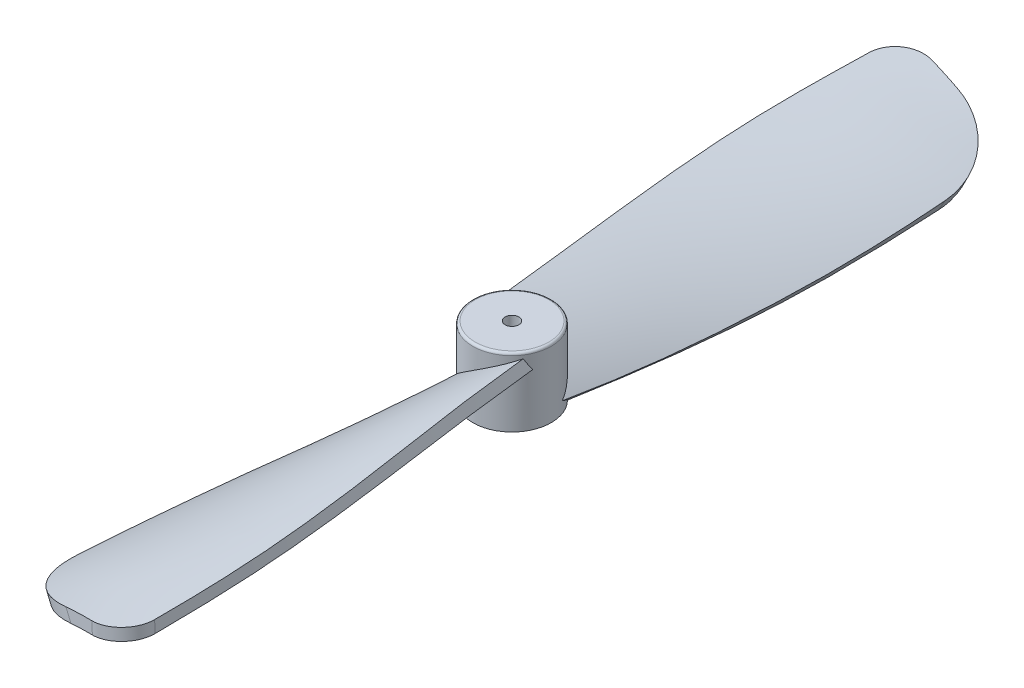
ISO-10303-21;
HEADER;
FILE_DESCRIPTION(('STEP AP214'),'2;1');
FILE_NAME('part.step','',(''),(''),'','','');
FILE_SCHEMA(('AUTOMOTIVE_DESIGN { 1 0 10303 214 1 1 1 1 }'));
ENDSEC;
DATA;
#1=APPLICATION_CONTEXT('core data for automotive mechanical design processes');
#2=APPLICATION_PROTOCOL_DEFINITION('international standard','automotive_design',2000,#1);
#3=PRODUCT_CONTEXT('',#1,'mechanical');
#4=PRODUCT('Part','Part','',(#3));
#5=PRODUCT_RELATED_PRODUCT_CATEGORY('part','',(#4));
#6=PRODUCT_DEFINITION_FORMATION('','',#4);
#7=PRODUCT_DEFINITION_CONTEXT('part definition',#1,'design');
#8=PRODUCT_DEFINITION('design','',#6,#7);
#9=PRODUCT_DEFINITION_SHAPE('','',#8);
#10=(LENGTH_UNIT() NAMED_UNIT(*) SI_UNIT(.MILLI.,.METRE.));
#11=(NAMED_UNIT(*) PLANE_ANGLE_UNIT() SI_UNIT($,.RADIAN.));
#12=(NAMED_UNIT(*) SI_UNIT($,.STERADIAN.) SOLID_ANGLE_UNIT());
#13=UNCERTAINTY_MEASURE_WITH_UNIT(LENGTH_MEASURE(1.E-05),#10,'distance_accuracy_value','');
#14=(GEOMETRIC_REPRESENTATION_CONTEXT(3) GLOBAL_UNCERTAINTY_ASSIGNED_CONTEXT((#13)) GLOBAL_UNIT_ASSIGNED_CONTEXT((#10,
#11,#12)) REPRESENTATION_CONTEXT('',''));
#15=CARTESIAN_POINT('',(0.,0.,0.));
#16=DIRECTION('',(0.,0.,1.));
#17=DIRECTION('',(1.,0.,0.));
#18=AXIS2_PLACEMENT_3D('',#15,#16,#17);
#19=CARTESIAN_POINT('',(33.3722870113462,12.6859658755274,0.));
#20=CARTESIAN_POINT('',(33.5505548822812,12.6952566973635,1.66850217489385));
#21=CARTESIAN_POINT('',(33.9209798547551,12.6894894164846,5.00697866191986));
#22=CARTESIAN_POINT('',(34.6357632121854,12.568867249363,9.96544878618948));
#23=CARTESIAN_POINT('',(35.1653324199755,12.4524844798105,15.0972853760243));
#24=CARTESIAN_POINT('',(35.2702382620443,12.3483058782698,18.970769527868));
#25=CARTESIAN_POINT('',(35.2336194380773,12.3031413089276,22.2645058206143));
#26=CARTESIAN_POINT('',(35.175529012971,12.2958204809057,23.3974248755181));
#27=CARTESIAN_POINT('',(32.059397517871,12.1151545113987,0.));
#28=CARTESIAN_POINT('',(32.0979541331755,12.0881679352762,1.66688017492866));
#29=CARTESIAN_POINT('',(32.1606552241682,12.2223477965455,5.00209014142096));
#30=CARTESIAN_POINT('',(32.5224793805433,12.2089764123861,9.98496376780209));
#31=CARTESIAN_POINT('',(32.8112551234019,12.2605266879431,15.0243706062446));
#32=CARTESIAN_POINT('',(32.9258766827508,12.2551682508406,19.1929046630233));
#33=CARTESIAN_POINT('',(32.9628140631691,12.1613963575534,21.9985223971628));
#34=CARTESIAN_POINT('',(32.9522804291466,12.1645787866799,23.0054061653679));
#35=CARTESIAN_POINT('',(30.9130203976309,11.2200845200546,0.));
#36=CARTESIAN_POINT('',(30.8118657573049,11.1568205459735,1.66525817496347));
#37=CARTESIAN_POINT('',(30.5784368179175,11.2406895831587,4.99736658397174));
#38=CARTESIAN_POINT('',(30.529614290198,11.3299189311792,10.0039021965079));
#39=CARTESIAN_POINT('',(30.5411905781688,11.4841012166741,14.9535896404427));
#40=CARTESIAN_POINT('',(30.6330981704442,11.6421808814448,19.4085438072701));
#41=CARTESIAN_POINT('',(30.736119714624,11.5963408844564,21.7403169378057));
#42=CARTESIAN_POINT('',(30.7731428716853,11.6100265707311,22.6211654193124));
#43=CARTESIAN_POINT('',(30.040836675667,10.0848312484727,0.));
#44=CARTESIAN_POINT('',(29.7999707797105,9.98528987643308,1.66363617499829));
#45=CARTESIAN_POINT('',(29.3702012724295,9.86345064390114,4.99323280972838));
#46=CARTESIAN_POINT('',(28.8374089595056,10.0096111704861,10.0207793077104));
#47=CARTESIAN_POINT('',(28.5605895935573,10.1932495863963,14.8904375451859));
#48=CARTESIAN_POINT('',(28.5570738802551,10.5524644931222,19.600958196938));
#49=CARTESIAN_POINT('',(28.6671330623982,10.6368832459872,21.5099196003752));
#50=CARTESIAN_POINT('',(28.7517130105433,10.6610721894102,22.2647327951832));
#51=B_SPLINE_SURFACE_WITH_KNOTS('',3,3,((#19,#20,#21,#22,#23,#24,#25,#26),(#27,#28,#29,#30,#31,
#32,#33,#34),(#35,#36,#37,#38,#39,#40,#41,#42),(#43,#44,#45,#46,#47,#48,#49,#50)),.UNSPECIFIED.,
.F.,.F.,.F.,(4,4),(4,1,1,1,1,4),(0.,1.),(0.,0.219405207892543,0.43874770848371,0.65752184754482,
0.875922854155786,1.),.UNSPECIFIED.);
#52=CARTESIAN_POINT('',(33.3722870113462,12.6859658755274,0.));
#53=CARTESIAN_POINT('',(33.5505548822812,12.6952566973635,1.66850217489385));
#54=CARTESIAN_POINT('',(33.9209798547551,12.6894894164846,5.00697866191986));
#55=CARTESIAN_POINT('',(34.6357632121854,12.568867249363,9.96544878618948));
#56=CARTESIAN_POINT('',(35.1653324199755,12.4524844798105,15.0972853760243));
#57=CARTESIAN_POINT('',(35.2702382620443,12.3483058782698,18.970769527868));
#58=CARTESIAN_POINT('',(35.2336194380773,12.3031413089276,22.2645058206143));
#59=CARTESIAN_POINT('',(35.175529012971,12.2958204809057,23.3974248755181));
#60=B_SPLINE_CURVE_WITH_KNOTS('',3,(#52,#53,#54,#55,#56,#57,#58,#59),.UNSPECIFIED.,.F.,.F.,(4,1,
1,1,1,4),(0.,0.219405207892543,0.43874770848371,0.65752184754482,0.875922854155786,1.),.UNSPECIFIED.);
#61=CARTESIAN_POINT('',(35.233491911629,12.3131022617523,21.6485530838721));
#62=VERTEX_POINT('',#61);
#63=CARTESIAN_POINT('',(33.4909002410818,12.6902554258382,1.0988355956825));
#64=VERTEX_POINT('',#63);
#65=EDGE_CURVE('E538',#62,#64,#60,.F.);
#66=CARTESIAN_POINT('',(33.4909002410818,12.6902554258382,1.09883559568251));
#67=CARTESIAN_POINT('',(33.459102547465,12.6750501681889,1.1472075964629));
#68=CARTESIAN_POINT('',(33.4253278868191,12.6589506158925,1.19398362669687));
#69=CARTESIAN_POINT('',(33.3542380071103,12.6250215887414,1.28405453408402));
#70=CARTESIAN_POINT('',(33.3169244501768,12.6071929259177,1.32735102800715));
#71=CARTESIAN_POINT('',(33.2393022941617,12.5699280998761,1.41004613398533));
#72=CARTESIAN_POINT('',(33.1990068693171,12.5504989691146,1.44946028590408));
#73=CARTESIAN_POINT('',(33.1157110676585,12.510024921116,1.52439146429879));
#74=CARTESIAN_POINT('',(33.0727104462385,12.4889798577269,1.55990813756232));
#75=CARTESIAN_POINT('',(32.9404097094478,12.423556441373,1.66025730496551));
#76=CARTESIAN_POINT('',(32.8476273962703,12.3768032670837,1.71908178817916));
#77=CARTESIAN_POINT('',(32.6562514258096,12.2774758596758,1.81991517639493));
#78=CARTESIAN_POINT('',(32.5576530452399,12.2248968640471,1.8619101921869));
#79=CARTESIAN_POINT('',(32.3506160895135,12.1105125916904,1.93157869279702));
#80=CARTESIAN_POINT('',(32.241977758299,12.0483165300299,1.9580146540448));
#81=CARTESIAN_POINT('',(32.0249458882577,11.9186929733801,1.99248871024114));
#82=CARTESIAN_POINT('',(31.9165524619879,11.8512634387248,2.00051959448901));
#83=CARTESIAN_POINT('',(31.6896931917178,11.703643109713,1.99936224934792));
#84=CARTESIAN_POINT('',(31.571601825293,11.6228968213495,1.98796553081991));
#85=CARTESIAN_POINT('',(31.3419464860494,11.4574289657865,1.94558697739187));
#86=CARTESIAN_POINT('',(31.2303852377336,11.3727057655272,1.91459703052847));
#87=CARTESIAN_POINT('',(31.0007785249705,11.1887312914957,1.82926981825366));
#88=CARTESIAN_POINT('',(30.8840178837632,11.0891088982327,1.77226777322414));
#89=CARTESIAN_POINT('',(30.6638482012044,10.889082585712,1.63722046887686));
#90=CARTESIAN_POINT('',(30.5604584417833,10.788677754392,1.55914531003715));
#91=CARTESIAN_POINT('',(30.3760496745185,10.5972817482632,1.38929971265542));
#92=CARTESIAN_POINT('',(30.2939666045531,10.5061264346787,1.29888537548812));
#93=CARTESIAN_POINT('',(30.182849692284,10.3739275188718,1.15072525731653));
#94=CARTESIAN_POINT('',(30.1478512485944,10.3306723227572,1.09932670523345));
#95=CARTESIAN_POINT('',(30.0821714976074,10.2462517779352,0.992256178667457));
#96=CARTESIAN_POINT('',(30.0514868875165,10.2050848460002,0.936587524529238));
#97=CARTESIAN_POINT('',(30.0083726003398,10.1445523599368,0.848441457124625));
#98=CARTESIAN_POINT('',(29.9942020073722,10.1241304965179,0.817527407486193));
#99=CARTESIAN_POINT('',(29.9672620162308,10.0842315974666,0.754492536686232));
#100=CARTESIAN_POINT('',(29.9544929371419,10.0647547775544,0.722371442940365));
#101=CARTESIAN_POINT('',(29.9424682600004,10.0458270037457,0.689643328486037));
#102=B_SPLINE_CURVE_WITH_KNOTS('',3,(#66,#67,#68,#69,#70,#71,#72,#73,#74,#75,#76,#77,#78,#79,
#80,#81,#82,#83,#84,#85,#86,#87,#88,#89,#90,#91,#92,#93,#94,#95,#96,#97,#98,#99,#100,#101),
.UNSPECIFIED.,.F.,.F.,(4,2,2,2,2,2,2,2,2,2,2,2,2,2,2,2,2,4),(0.,0.179474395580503,
0.358864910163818,0.537505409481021,0.716162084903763,1.07264630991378,1.42942413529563,
1.8116913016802,2.19410820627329,2.62294513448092,3.05195972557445,3.54114046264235,
4.03101895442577,4.48631083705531,4.71334369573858,4.94020177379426,5.05915756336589,
5.17814037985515),.UNSPECIFIED.);
#103=CARTESIAN_POINT('',(29.9424682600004,10.0458270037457,0.689643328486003));
#104=VERTEX_POINT('',#103);
#105=EDGE_CURVE('E758',#64,#104,#102,.T.);
#106=CARTESIAN_POINT('',(30.040836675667,10.0848312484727,0.));
#107=CARTESIAN_POINT('',(29.7999707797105,9.98528987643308,1.66363617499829));
#108=CARTESIAN_POINT('',(29.3702012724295,9.86345064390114,4.99323280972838));
#109=CARTESIAN_POINT('',(28.8374089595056,10.0096111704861,10.0207793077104));
#110=CARTESIAN_POINT('',(28.5605895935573,10.1932495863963,14.8904375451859));
#111=CARTESIAN_POINT('',(28.5570738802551,10.5524644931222,19.600958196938));
#112=CARTESIAN_POINT('',(28.6671330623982,10.6368832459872,21.5099196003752));
#113=CARTESIAN_POINT('',(28.7517130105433,10.6610721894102,22.2647327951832));
#114=B_SPLINE_CURVE_WITH_KNOTS('',3,(#106,#107,#108,#109,#110,#111,#112,#113),.UNSPECIFIED.,.F.,
.F.,(4,1,1,1,1,4),(0.,0.219405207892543,0.43874770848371,0.65752184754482,0.875922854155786,1.),.UNSPECIFIED.);
#115=CARTESIAN_POINT('',(28.5772905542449,10.4846052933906,18.8405582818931));
#116=VERTEX_POINT('',#115);
#117=EDGE_CURVE('E467',#104,#116,#114,.T.);
#118=CARTESIAN_POINT('',(32.9705001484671,9.81597260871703,23.0086187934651));
#119=CARTESIAN_POINT('',(29.7981423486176,8.01447927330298,22.4492465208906));
#120=CARTESIAN_POINT('',(30.0643682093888,7.80419815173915,18.7740546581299));
#121=CARTESIAN_POINT('',(32.7250735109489,10.261594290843,22.965343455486));
#122=CARTESIAN_POINT('',(29.5972301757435,8.47708985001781,22.4138202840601));
#123=CARTESIAN_POINT('',(29.8173968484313,8.2486526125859,18.7845841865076));
#124=CARTESIAN_POINT('',(32.4788763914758,10.7067783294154,22.9219322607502));
#125=CARTESIAN_POINT('',(29.3939234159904,8.94189327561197,22.3779718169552));
#126=CARTESIAN_POINT('',(29.5705449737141,8.6932025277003,18.7954309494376));
#127=CARTESIAN_POINT('',(32.1064379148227,11.3774348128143,22.8562613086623));
#128=CARTESIAN_POINT('',(29.0846010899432,9.64383446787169,22.3234299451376));
#129=CARTESIAN_POINT('',(29.1985231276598,9.36372508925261,18.8121151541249));
#130=CARTESIAN_POINT('',(31.9807756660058,11.6032389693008,22.8341036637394));
#131=CARTESIAN_POINT('',(28.9803673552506,9.87949748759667,22.3050507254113));
#132=CARTESIAN_POINT('',(29.0732414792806,9.58962485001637,18.8177914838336));
#133=CARTESIAN_POINT('',(31.8302533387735,11.8731394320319,22.8075625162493));
#134=CARTESIAN_POINT('',(28.8550411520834,10.1617801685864,22.2829523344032));
#135=CARTESIAN_POINT('',(28.9234680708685,9.85980984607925,18.8246311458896));
#136=CARTESIAN_POINT('',(31.8055882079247,11.9173478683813,22.803213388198));
#137=CARTESIAN_POINT('',(28.8345450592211,10.2079113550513,22.2793383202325));
#138=CARTESIAN_POINT('',(28.8989350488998,9.90407035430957,18.8257532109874));
#139=CARTESIAN_POINT('',(31.7809152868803,11.96155182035,22.798862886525));
#140=CARTESIAN_POINT('',(28.814025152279,10.254062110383,22.275720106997));
#141=CARTESIAN_POINT('',(28.8744037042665,9.94833185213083,18.8268768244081));
#142=CARTESIAN_POINT('',(31.7745970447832,11.9728715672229,22.7977488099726));
#143=CARTESIAN_POINT('',(28.8087740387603,10.2658722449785,22.2747941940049));
#144=CARTESIAN_POINT('',(28.8681217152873,9.95966633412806,18.8271645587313));
#145=CARTESIAN_POINT('',(31.7682782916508,11.9841910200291,22.7966346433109));
#146=CARTESIAN_POINT('',(28.8035213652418,10.2776836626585,22.2738680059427));
#147=CARTESIAN_POINT('',(28.8618398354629,9.97100088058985,18.8274523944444));
#148=CARTESIAN_POINT('',(31.7309628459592,12.0510309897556,22.7900549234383));
#149=CARTESIAN_POINT('',(28.7725162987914,10.3473900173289,22.2684009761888));
#150=CARTESIAN_POINT('',(28.8247457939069,10.0379320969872,18.8291526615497));
#151=CARTESIAN_POINT('',(31.6999543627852,12.106544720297,22.7845872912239));
#152=CARTESIAN_POINT('',(28.7467279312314,10.405314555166,22.2638537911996));
#153=CARTESIAN_POINT('',(28.7939361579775,10.0935302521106,18.8305673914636));
#154=CARTESIAN_POINT('',(31.6379127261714,12.2175579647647,22.7736476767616));
#155=CARTESIAN_POINT('',(28.6951114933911,10.5211452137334,22.2547524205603));
#156=CARTESIAN_POINT('',(28.7323222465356,10.2047296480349,18.8334012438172));
#157=CARTESIAN_POINT('',(31.6068795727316,12.2730574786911,22.7681756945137));
#158=CARTESIAN_POINT('',(28.6692834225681,10.5790514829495,22.2501982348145));
#159=CARTESIAN_POINT('',(28.7015179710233,10.2603308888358,18.8348203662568));
#160=CARTESIAN_POINT('',(31.5447886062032,12.3840422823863,22.7572273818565));
#161=CARTESIAN_POINT('',(28.6175875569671,10.6948455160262,22.2410828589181));
#162=CARTESIAN_POINT('',(28.6399148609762,10.3715364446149,18.8376626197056));
#163=CARTESIAN_POINT('',(31.5137307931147,12.4395275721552,22.7517510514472));
#164=CARTESIAN_POINT('',(28.5917197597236,10.752733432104,22.2365216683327));
#165=CARTESIAN_POINT('',(28.6091160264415,10.4271407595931,18.8390857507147));
#166=CARTESIAN_POINT('',(31.482314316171,12.4956237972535,22.7462114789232));
#167=CARTESIAN_POINT('',(28.5655258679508,10.8112962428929,22.2319029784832));
#168=CARTESIAN_POINT('',(28.5779768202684,10.4833661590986,18.8405265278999));
#169=CARTESIAN_POINT('',(31.4819681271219,12.4962419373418,22.7461504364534));
#170=CARTESIAN_POINT('',(28.5652374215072,10.8119411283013,22.2318521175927));
#171=CARTESIAN_POINT('',(28.57763368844,10.4839857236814,18.8405424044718));
#172=CARTESIAN_POINT('',(31.4816219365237,12.4968600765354,22.7460893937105));
#173=CARTESIAN_POINT('',(28.5649489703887,10.8125860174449,22.2318012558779));
#174=CARTESIAN_POINT('',(28.5772905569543,10.4846052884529,18.840558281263));
#175=CARTESIAN_POINT('',(31.4508854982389,12.5517128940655,22.74066973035));
#176=CARTESIAN_POINT('',(28.5392952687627,10.869887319,22.2272778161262));
#177=CARTESIAN_POINT('',(28.5468403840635,10.539593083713,18.8419690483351));
#178=CARTESIAN_POINT('',(31.4201490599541,12.6065657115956,22.7352500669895));
#179=CARTESIAN_POINT('',(28.5136760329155,10.9271116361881,22.2227604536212));
#180=CARTESIAN_POINT('',(28.5163902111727,10.5945808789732,18.8433798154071));
#181=CARTESIAN_POINT('',(31.3894126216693,12.6614185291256,22.729830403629));
#182=CARTESIAN_POINT('',(28.4880911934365,10.9842591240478,22.2182491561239));
#183=CARTESIAN_POINT('',(28.4859400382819,10.6495686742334,18.8447905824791));
#184=(BOUNDED_SURFACE() B_SPLINE_SURFACE(3,2,((#118,#119,#120),(#121,#122,#123),(#124,#125,
#126),(#127,#128,#129),(#130,#131,#132),(#133,#134,#135),(#136,#137,#138),(#139,#140,#141),
(#142,#143,#144),(#145,#146,#147),(#148,#149,#150),(#151,#152,#153),(#154,#155,#156),(#157,#158,
#159),(#160,#161,#162),(#163,#164,#165),(#166,#167,#168),(#169,#170,#171),(#172,#173,#174),
(#175,#176,#177),(#178,#179,#180),(#181,#182,#183)),.UNSPECIFIED.,.F.,.F.,
.F.) B_SPLINE_SURFACE_WITH_KNOTS((4,2,2,3,2,2,2,2,3,4),(3,3),(0.,1.53172044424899,
2.30981083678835,2.46224122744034,2.50127559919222,2.69274036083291,2.88420512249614,
3.0756698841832,3.07780319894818,3.2671346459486),(0.,1.),
.UNSPECIFIED.) GEOMETRIC_REPRESENTATION_ITEM() RATIONAL_B_SPLINE_SURFACE(((1.,0.747236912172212,
1.),(1.,0.751530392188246,1.),(1.,0.755810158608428,1.),(1.,0.762232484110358,1.),(1.,
0.764390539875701,1.),(1.,0.766963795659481,1.),(1.,0.767385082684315,1.),(1.,0.767806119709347,
1.),(1.,0.767913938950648,1.),(1.,0.76802174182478,1.),(1.,0.768658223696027,1.),(1.,
0.769186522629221,1.),(1.,0.770242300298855,1.),(1.,0.770769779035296,1.),(1.,0.771823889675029,
1.),(1.,0.772350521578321,1.),(1.,0.7728825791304,1.),(1.,0.772888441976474,1.),(1.,
0.772894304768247,1.),(1.,0.773414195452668,1.),(1.,0.773934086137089,1.),(1.,0.774453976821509,1.))) REPRESENTATION_ITEM('') SURFACE());
#185=CARTESIAN_POINT('',(28.5772905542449,10.4846052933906,18.8405582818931));
#186=CARTESIAN_POINT('',(28.5788118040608,10.4922755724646,18.9563351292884));
#187=CARTESIAN_POINT('',(28.5847065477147,10.5021282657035,19.0719091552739));
#188=CARTESIAN_POINT('',(28.6053173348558,10.525789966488,19.3018614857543));
#189=CARTESIAN_POINT('',(28.620033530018,10.5395990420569,19.4162397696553));
#190=CARTESIAN_POINT('',(28.6583446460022,10.5707510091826,19.6429068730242));
#191=CARTESIAN_POINT('',(28.6819317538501,10.5880907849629,19.755197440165));
#192=CARTESIAN_POINT('',(28.7379991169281,10.6258104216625,19.9770099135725));
#193=CARTESIAN_POINT('',(28.770479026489,10.6461901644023,20.0865319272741));
#194=CARTESIAN_POINT('',(28.8443014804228,10.6895025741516,20.3021494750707));
#195=CARTESIAN_POINT('',(28.8856524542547,10.7124376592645,20.4082416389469));
#196=CARTESIAN_POINT('',(28.9769902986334,10.7604249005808,20.6161429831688));
#197=CARTESIAN_POINT('',(29.0269773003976,10.7854770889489,20.7179520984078));
#198=CARTESIAN_POINT('',(29.1352170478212,10.8373787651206,20.9165254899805));
#199=CARTESIAN_POINT('',(29.193465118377,10.8642272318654,21.0132925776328));
#200=CARTESIAN_POINT('',(29.3177903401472,10.919514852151,21.2011975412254));
#201=CARTESIAN_POINT('',(29.3838704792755,10.947954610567,21.2923332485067));
#202=CARTESIAN_POINT('',(29.5924864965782,11.0351590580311,21.5555945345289));
#203=CARTESIAN_POINT('',(29.7459379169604,11.0960666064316,21.7185587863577));
#204=CARTESIAN_POINT('',(30.0775170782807,11.2216576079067,22.0155693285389));
#205=CARTESIAN_POINT('',(30.2556636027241,11.2863439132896,22.1495934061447));
#206=CARTESIAN_POINT('',(30.5398802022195,11.3844645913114,22.3278128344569));
#207=CARTESIAN_POINT('',(30.6387100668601,11.4177486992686,22.3839320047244));
#208=CARTESIAN_POINT('',(30.8409449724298,11.4839285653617,22.4874489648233));
#209=CARTESIAN_POINT('',(30.9443483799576,11.5168244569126,22.5348498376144));
#210=CARTESIAN_POINT('',(31.1548851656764,11.5816704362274,22.6206249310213));
#211=CARTESIAN_POINT('',(31.2620120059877,11.6136220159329,22.6590141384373));
#212=CARTESIAN_POINT('',(31.4794338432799,11.6761611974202,22.7267089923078));
#213=CARTESIAN_POINT('',(31.5897269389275,11.706749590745,22.7560199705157));
#214=CARTESIAN_POINT('',(31.7309394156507,11.7443754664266,22.7873510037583));
#215=CARTESIAN_POINT('',(31.7607392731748,11.7522303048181,22.7936189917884));
#216=CARTESIAN_POINT('',(31.8204747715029,11.7678036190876,22.805501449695));
#217=CARTESIAN_POINT('',(31.8504102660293,11.7755222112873,22.8111165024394));
#218=CARTESIAN_POINT('',(31.8804227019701,11.7831740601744,22.8164087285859));
#219=B_SPLINE_CURVE_WITH_KNOTS('',3,(#185,#186,#187,#188,#189,#190,#191,#192,#193,#194,#195,
#196,#197,#198,#199,#200,#201,#202,#203,#204,#205,#206,#207,#208,#209,#210,#211,#212,#213,#214,
#215,#216,#217,#218),.UNSPECIFIED.,.F.,.F.,(4,2,2,2,2,2,2,2,2,2,2,2,2,2,2,2,4),(0.,
0.348019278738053,0.696044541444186,1.04376399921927,1.39146994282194,1.73950775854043,
2.08755086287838,2.43539778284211,2.78337783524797,3.47592527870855,4.16900240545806,
4.52393285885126,4.87873755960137,5.23294795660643,5.58694992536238,5.68129143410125,
5.77554806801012),.UNSPECIFIED.);
#220=CARTESIAN_POINT('',(31.8804225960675,11.7831744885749,22.8164087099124));
#221=VERTEX_POINT('',#220);
#222=EDGE_CURVE('E377',#116,#221,#219,.T.);
#223=CARTESIAN_POINT('',(36.2065421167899,-5.71267633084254,23.5792203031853));
#224=DIRECTION('',(-0.173648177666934,0.,0.984807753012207));
#225=DIRECTION('',(0.984807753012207,0.,0.173648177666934));
#226=AXIS2_PLACEMENT_3D('',#223,#224,#225);
#227=CIRCLE('',#226,18.0389022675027);
#228=CARTESIAN_POINT('',(33.4819655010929,12.1128083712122,23.0988039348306));
#229=VERTEX_POINT('',#228);
#230=EDGE_CURVE('E371',#229,#221,#227,.T.);
#231=CARTESIAN_POINT('',(35.2908920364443,11.2615871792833,21.6464816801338));
#232=CARTESIAN_POINT('',(35.2712127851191,11.2774737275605,23.4142965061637));
#233=CARTESIAN_POINT('',(33.5327272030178,11.1799603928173,23.1077545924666));
#234=CARTESIAN_POINT('',(35.2846670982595,11.3757616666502,21.6466937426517));
#235=CARTESIAN_POINT('',(35.2634707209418,11.3914922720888,23.4129313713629));
#236=CARTESIAN_POINT('',(33.526517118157,11.2941173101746,23.1066595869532));
#237=CARTESIAN_POINT('',(35.2784396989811,11.489936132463,21.6469099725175));
#238=CARTESIAN_POINT('',(35.2557212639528,11.5055700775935,23.41156493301));
#239=CARTESIAN_POINT('',(33.5203063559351,11.4082741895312,23.1055644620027));
#240=CARTESIAN_POINT('',(35.2702209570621,11.6405607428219,21.6472007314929));
#241=CARTESIAN_POINT('',(35.2454897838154,11.6561198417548,23.4097608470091));
#242=CARTESIAN_POINT('',(33.5121119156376,11.5588755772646,23.1041195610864));
#243=CARTESIAN_POINT('',(35.2682318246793,11.6770109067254,21.6472715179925));
#244=CARTESIAN_POINT('',(35.2430143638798,11.6925390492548,23.4093243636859));
#245=CARTESIAN_POINT('',(33.5101288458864,11.595320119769,23.1037698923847));
#246=CARTESIAN_POINT('',(35.2662424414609,11.713461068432,21.64734272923));
#247=CARTESIAN_POINT('',(35.2405381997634,11.728964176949,23.4088877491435));
#248=CARTESIAN_POINT('',(33.5081457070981,11.6317646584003,23.1034202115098));
#249=CARTESIAN_POINT('',(35.2651161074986,11.7340981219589,21.6473830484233));
#250=CARTESIAN_POINT('',(35.2391366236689,11.7495817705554,23.4086406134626));
#251=CARTESIAN_POINT('',(33.5070229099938,11.6523985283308,23.1032222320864));
#252=CARTESIAN_POINT('',(35.2639896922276,11.7547351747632,21.647423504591));
#253=CARTESIAN_POINT('',(35.2377348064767,11.7702012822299,23.4083934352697));
#254=CARTESIAN_POINT('',(33.5059000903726,11.6730323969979,23.1030242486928));
#255=CARTESIAN_POINT('',(35.2597470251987,11.8324594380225,21.6475763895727));
#256=CARTESIAN_POINT('',(35.2324556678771,11.8478466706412,23.4074625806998));
#257=CARTESIAN_POINT('',(33.5016711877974,11.7507446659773,23.10227857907));
#258=CARTESIAN_POINT('',(35.2566302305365,11.8895466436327,21.6476897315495));
#259=CARTESIAN_POINT('',(35.2285767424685,11.9048852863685,23.4067786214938));
#260=CARTESIAN_POINT('',(33.4985649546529,11.8078230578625,23.1017308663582));
#261=CARTESIAN_POINT('',(35.2506424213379,11.9991971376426,21.6479094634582));
#262=CARTESIAN_POINT('',(35.2211244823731,12.0144447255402,23.4054645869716));
#263=CARTESIAN_POINT('',(33.4925983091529,11.9174566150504,23.1006787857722));
#264=CARTESIAN_POINT('',(35.2477715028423,12.0517604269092,21.6480156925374));
#265=CARTESIAN_POINT('',(35.2175514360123,12.0669632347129,23.404834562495));
#266=CARTESIAN_POINT('',(33.489737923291,11.9700117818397,23.1001744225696));
#267=CARTESIAN_POINT('',(35.2420285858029,12.1568869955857,21.6482299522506));
#268=CARTESIAN_POINT('',(35.2104038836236,12.1720002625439,23.4035742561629));
#269=CARTESIAN_POINT('',(33.4840168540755,12.0751220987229,23.0991656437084));
#270=CARTESIAN_POINT('',(35.239156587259,12.2094502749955,21.6483379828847));
#271=CARTESIAN_POINT('',(35.2068293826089,12.2245187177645,23.4029439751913));
#272=CARTESIAN_POINT('',(33.481156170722,12.1276772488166,23.0986612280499));
#273=CARTESIAN_POINT('',(35.2353533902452,12.2790431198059,21.6484822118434));
#274=CARTESIAN_POINT('',(35.2020950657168,12.2940634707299,23.4021091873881));
#275=CARTESIAN_POINT('',(33.4773684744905,12.1972593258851,23.0979933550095));
#276=CARTESIAN_POINT('',(35.2344226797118,12.2960726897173,21.6485176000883));
#277=CARTESIAN_POINT('',(35.2009366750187,12.3110785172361,23.4019049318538));
#278=CARTESIAN_POINT('',(33.4764415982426,12.2142862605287,23.0978299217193));
#279=CARTESIAN_POINT('',(35.2334919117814,12.3131022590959,21.6485530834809));
#280=CARTESIAN_POINT('',(35.1997781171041,12.3280948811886,23.4017006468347));
#281=CARTESIAN_POINT('',(33.4755147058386,12.2313131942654,23.0976664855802));
#282=CARTESIAN_POINT('',(35.2315495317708,12.3486359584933,21.648627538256));
#283=CARTESIAN_POINT('',(35.197359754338,12.3636097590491,23.4012742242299));
#284=CARTESIAN_POINT('',(33.4735805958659,12.2668413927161,23.0973254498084));
#285=CARTESIAN_POINT('',(35.2296071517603,12.3841696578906,21.648701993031));
#286=CARTESIAN_POINT('',(35.1949421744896,12.3991131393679,23.4008479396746));
#287=CARTESIAN_POINT('',(33.4716464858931,12.3023695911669,23.0969844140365));
#288=CARTESIAN_POINT('',(35.2276647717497,12.419703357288,21.648776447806));
#289=CARTESIAN_POINT('',(35.1925253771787,12.4346050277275,23.4004217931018));
#290=CARTESIAN_POINT('',(33.4697123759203,12.3378977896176,23.0966433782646));
#291=(BOUNDED_SURFACE() B_SPLINE_SURFACE(3,2,((#231,#232,#233),(#234,#235,#236),(#237,#238,
#239),(#240,#241,#242),(#243,#244,#245),(#246,#247,#248),(#249,#250,#251),(#252,#253,#254),
(#255,#256,#257),(#258,#259,#260),(#261,#262,#263),(#264,#265,#266),(#267,#268,#269),(#270,#271,
#272),(#273,#274,#275),(#276,#277,#278),(#279,#280,#281),(#282,#283,#284),(#285,#286,#287),
(#288,#289,#290)),.UNSPECIFIED.,.F.,.F.,.F.) B_SPLINE_SURFACE_WITH_KNOTS((4,2,3,2,2,2,2,3,4),(3,
3),(0.,0.342992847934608,0.452493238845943,0.514489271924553,0.685985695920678,
0.843891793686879,1.001797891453,1.05295667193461,1.15970398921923),(0.,1.),
.UNSPECIFIED.) GEOMETRIC_REPRESENTATION_ITEM() RATIONAL_B_SPLINE_SURFACE(((1.,0.646947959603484,
1.),(1.,0.647280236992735,1.),(1.,0.647613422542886,1.),(1.,0.648054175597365,1.),(1.,
0.648160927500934,1.),(1.,0.648267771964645,1.),(1.,0.648328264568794,1.),(1.,0.64838878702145,
1.),(1.,0.648616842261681,1.),(1.,0.648784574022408,1.),(1.,0.649107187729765,1.),(1.,
0.649262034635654,1.),(1.,0.649572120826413,1.),(1.,0.649727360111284,1.),(1.,0.649933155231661,
1.),(1.,0.649983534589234,1.),(1.,0.650033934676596,1.),(1.,0.65013918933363,1.),(1.,
0.650244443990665,1.),(1.,0.650349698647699,1.))) REPRESENTATION_ITEM('') SURFACE());
#292=CARTESIAN_POINT('',(33.4819655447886,12.1128080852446,23.0988039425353));
#293=CARTESIAN_POINT('',(33.5231782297,12.1193043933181,23.1060704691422));
#294=CARTESIAN_POINT('',(33.5646968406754,12.1256882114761,23.1115870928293));
#295=CARTESIAN_POINT('',(33.6480902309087,12.1381929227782,23.1190876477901));
#296=CARTESIAN_POINT('',(33.6899650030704,12.144313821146,23.1210716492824));
#297=CARTESIAN_POINT('',(33.8156086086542,12.1622065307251,23.1216750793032));
#298=CARTESIAN_POINT('',(33.8995300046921,12.1735293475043,23.1149693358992));
#299=CARTESIAN_POINT('',(34.0652243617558,12.1947497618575,23.087456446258));
#300=CARTESIAN_POINT('',(34.1469959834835,12.2046464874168,23.0666407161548));
#301=CARTESIAN_POINT('',(34.3060100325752,12.222949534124,23.0114660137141));
#302=CARTESIAN_POINT('',(34.3832531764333,12.2313560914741,22.9771091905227));
#303=CARTESIAN_POINT('',(34.5307553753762,12.2466934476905,22.8959248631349));
#304=CARTESIAN_POINT('',(34.6010332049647,12.253628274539,22.8491322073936));
#305=CARTESIAN_POINT('',(34.732814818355,12.26615444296,22.7443513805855));
#306=CARTESIAN_POINT('',(34.7943189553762,12.2717458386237,22.6863636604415));
#307=CARTESIAN_POINT('',(34.9067216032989,12.2817195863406,22.5609056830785));
#308=CARTESIAN_POINT('',(34.9576294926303,12.2861030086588,22.4934439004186));
#309=CARTESIAN_POINT('',(35.047469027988,12.2938223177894,22.3508409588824));
#310=CARTESIAN_POINT('',(35.0863970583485,12.2971578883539,22.2756974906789));
#311=CARTESIAN_POINT('',(35.1367719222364,12.3016419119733,22.1544910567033));
#312=CARTESIAN_POINT('',(35.1527576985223,12.3031051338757,22.1102688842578));
#313=CARTESIAN_POINT('',(35.1805258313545,12.3057703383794,22.0204967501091));
#314=CARTESIAN_POINT('',(35.1923076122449,12.3069722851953,21.9749466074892));
#315=CARTESIAN_POINT('',(35.2115672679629,12.3091331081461,21.8828470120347));
#316=CARTESIAN_POINT('',(35.2190364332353,12.3100914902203,21.8362957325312));
#317=CARTESIAN_POINT('',(35.2295767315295,12.3117717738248,21.7426953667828));
#318=CARTESIAN_POINT('',(35.2326480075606,12.312493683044,21.6956462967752));
#319=CARTESIAN_POINT('',(35.233491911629,12.3131022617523,21.6485530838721));
#320=B_SPLINE_CURVE_WITH_KNOTS('',3,(#292,#293,#294,#295,#296,#297,#298,#299,#300,#301,#302,
#303,#304,#305,#306,#307,#308,#309,#310,#311,#312,#313,#314,#315,#316,#317,#318,#319),
.UNSPECIFIED.,.F.,.F.,(4,2,2,2,2,2,2,2,2,2,2,2,2,4),(0.,0.126971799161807,0.253941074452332,
0.507474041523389,0.761161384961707,1.01480848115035,1.26775215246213,1.52068563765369,
1.77339429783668,2.02617915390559,2.16713809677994,2.30811633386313,2.44937829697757,
2.59063566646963),.UNSPECIFIED.);
#321=EDGE_CURVE('E526',#229,#62,#320,.T.);
#322=ORIENTED_EDGE('',*,*,#65,.T.);
#323=ORIENTED_EDGE('',*,*,#105,.T.);
#324=ORIENTED_EDGE('',*,*,#117,.T.);
#325=ORIENTED_EDGE('',*,*,#222,.T.);
#326=ORIENTED_EDGE('',*,*,#230,.F.);
#327=ORIENTED_EDGE('',*,*,#321,.T.);
#328=EDGE_LOOP('',(#322,#323,#324,#325,#326,#327));
#329=FACE_BOUND('',#328,.T.);
#330=ADVANCED_FACE('F89',(#329),#51,.T.);
#331=CARTESIAN_POINT('',(30.040836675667,10.0848312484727,0.));
#332=CARTESIAN_POINT('',(29.7999707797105,9.98528987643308,1.66363617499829));
#333=CARTESIAN_POINT('',(29.3702012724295,9.86345064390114,4.99323280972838));
#334=CARTESIAN_POINT('',(28.8374089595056,10.0096111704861,10.0207793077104));
#335=CARTESIAN_POINT('',(28.5605895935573,10.1932495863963,14.8904375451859));
#336=CARTESIAN_POINT('',(28.5570738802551,10.5524644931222,19.600958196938));
#337=CARTESIAN_POINT('',(28.6671330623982,10.6368832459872,21.5099196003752));
#338=CARTESIAN_POINT('',(28.7517130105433,10.6610721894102,22.2647327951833));
#339=CARTESIAN_POINT('',(30.1734055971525,9.95014201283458,0.));
#340=CARTESIAN_POINT('',(29.9424720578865,9.84875566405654,1.66422700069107));
#341=CARTESIAN_POINT('',(29.5247944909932,9.7221205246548,4.99316108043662));
#342=CARTESIAN_POINT('',(28.9508387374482,9.85055492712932,10.0201450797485));
#343=CARTESIAN_POINT('',(28.6790195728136,10.0275200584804,14.8930363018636));
#344=CARTESIAN_POINT('',(28.652365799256,10.3700539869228,19.5929888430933));
#345=CARTESIAN_POINT('',(28.7535598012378,10.4542131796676,21.5194654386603));
#346=CARTESIAN_POINT('',(28.8335782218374,10.4792559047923,22.2791678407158));
#347=CARTESIAN_POINT('',(30.3059745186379,9.81545277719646,0.));
#348=CARTESIAN_POINT('',(30.0849733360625,9.71222145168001,1.66481782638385));
#349=CARTESIAN_POINT('',(29.6793877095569,9.58079040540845,4.99308935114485));
#350=CARTESIAN_POINT('',(29.0642685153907,9.69149868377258,10.0195108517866));
#351=CARTESIAN_POINT('',(28.7974495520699,9.86179053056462,14.8956350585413));
#352=CARTESIAN_POINT('',(28.747657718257,10.1876434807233,19.5850194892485));
#353=CARTESIAN_POINT('',(28.8399865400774,10.271543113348,21.5290112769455));
#354=CARTESIAN_POINT('',(28.9154434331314,10.2974396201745,22.2936028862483));
#355=CARTESIAN_POINT('',(30.4385434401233,9.68076354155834,0.));
#356=CARTESIAN_POINT('',(30.2274746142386,9.57568723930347,1.66540865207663));
#357=CARTESIAN_POINT('',(29.8339809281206,9.4394602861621,4.99301762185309));
#358=CARTESIAN_POINT('',(29.1776982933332,9.53244244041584,10.0188766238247));
#359=CARTESIAN_POINT('',(28.9158795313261,9.69606100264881,14.898233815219));
#360=CARTESIAN_POINT('',(28.8429496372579,10.0052329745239,19.5770501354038));
#361=CARTESIAN_POINT('',(28.926413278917,10.0888730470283,21.5385571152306));
#362=CARTESIAN_POINT('',(28.9973086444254,10.1156233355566,22.3080379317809));
#363=B_SPLINE_SURFACE_WITH_KNOTS('',3,3,((#331,#332,#333,#334,#335,#336,#337,#338),(#339,#340,
#341,#342,#343,#344,#345,#346),(#347,#348,#349,#350,#351,#352,#353,#354),(#355,#356,#357,#358,
#359,#360,#361,#362)),.UNSPECIFIED.,.F.,.F.,.F.,(4,4),(4,1,1,1,1,4),(0.,1.),(0.,
0.219405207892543,0.43874770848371,0.65752184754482,0.875922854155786,1.),.UNSPECIFIED.);
#364=CARTESIAN_POINT('',(29.9424682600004,10.0458270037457,0.689643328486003));
#365=CARTESIAN_POINT('',(29.9585352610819,10.0214484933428,0.733377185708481));
#366=CARTESIAN_POINT('',(29.9759402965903,9.99608169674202,0.776040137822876));
#367=CARTESIAN_POINT('',(30.0131634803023,9.94362911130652,0.85913838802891));
#368=CARTESIAN_POINT('',(30.0329792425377,9.91654503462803,0.899575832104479));
#369=CARTESIAN_POINT('',(30.0864847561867,9.84529892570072,1.00021323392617));
#370=CARTESIAN_POINT('',(30.1217363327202,9.80005626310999,1.05881932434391));
#371=CARTESIAN_POINT('',(30.1970889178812,9.70618090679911,1.17106699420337));
#372=CARTESIAN_POINT('',(30.2372316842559,9.65752077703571,1.22465775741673));
#373=CARTESIAN_POINT('',(30.2792550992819,9.60772011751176,1.27542422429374));
#374=B_SPLINE_CURVE_WITH_KNOTS('',3,(#364,#365,#366,#367,#368,#369,#370,#371,#372,#373),
.UNSPECIFIED.,.F.,.F.,(4,2,2,2,4),(0.,0.157679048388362,0.315203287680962,0.560815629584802,
0.8086950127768),.UNSPECIFIED.);
#375=CARTESIAN_POINT('',(30.2792550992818,9.60772011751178,1.27542422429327));
#376=VERTEX_POINT('',#375);
#377=EDGE_CURVE('E439',#104,#376,#374,.T.);
#378=CARTESIAN_POINT('',(30.4385434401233,9.68076354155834,0.));
#379=CARTESIAN_POINT('',(30.2274746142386,9.57568723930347,1.66540865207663));
#380=CARTESIAN_POINT('',(29.8339809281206,9.4394602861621,4.99301762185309));
#381=CARTESIAN_POINT('',(29.1776982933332,9.53244244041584,10.0188766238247));
#382=CARTESIAN_POINT('',(28.9158795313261,9.69606100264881,14.898233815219));
#383=CARTESIAN_POINT('',(28.8429496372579,10.0052329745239,19.5770501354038));
#384=CARTESIAN_POINT('',(28.926413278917,10.0888730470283,21.5385571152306));
#385=CARTESIAN_POINT('',(28.9973086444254,10.1156233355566,22.3080379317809));
#386=B_SPLINE_CURVE_WITH_KNOTS('',3,(#378,#379,#380,#381,#382,#383,#384,#385),.UNSPECIFIED.,.F.,
.F.,(4,1,1,1,1,4),(0.,0.219405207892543,0.43874770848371,0.65752184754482,0.875922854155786,1.),.UNSPECIFIED.);
#387=CARTESIAN_POINT('',(28.8744037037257,9.94833185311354,18.8268768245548));
#388=VERTEX_POINT('',#387);
#389=EDGE_CURVE('E546',#376,#388,#386,.T.);
#390=CARTESIAN_POINT('',(30.0643682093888,7.80419815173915,18.7740546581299));
#391=CARTESIAN_POINT('',(29.8173968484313,8.2486526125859,18.7845841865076));
#392=CARTESIAN_POINT('',(29.5705449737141,8.6932025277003,18.7954309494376));
#393=CARTESIAN_POINT('',(29.1985231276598,9.36372508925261,18.8121151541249));
#394=CARTESIAN_POINT('',(29.0732414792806,9.58962485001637,18.8177914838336));
#395=CARTESIAN_POINT('',(28.9234680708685,9.85980984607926,18.8246311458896));
#396=CARTESIAN_POINT('',(28.8989350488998,9.90407035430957,18.8257532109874));
#397=CARTESIAN_POINT('',(28.8744037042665,9.94833185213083,18.8268768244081));
#398=CARTESIAN_POINT('',(28.8681217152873,9.95966633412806,18.8271645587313));
#399=CARTESIAN_POINT('',(28.8618398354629,9.97100088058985,18.8274523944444));
#400=CARTESIAN_POINT('',(28.8247457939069,10.0379320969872,18.8291526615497));
#401=CARTESIAN_POINT('',(28.7939361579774,10.0935302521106,18.8305673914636));
#402=CARTESIAN_POINT('',(28.7323222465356,10.2047296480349,18.8334012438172));
#403=CARTESIAN_POINT('',(28.7015179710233,10.2603308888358,18.8348203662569));
#404=CARTESIAN_POINT('',(28.6399148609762,10.3715364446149,18.8376626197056));
#405=CARTESIAN_POINT('',(28.6091160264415,10.4271407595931,18.8390857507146));
#406=CARTESIAN_POINT('',(28.5779768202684,10.4833661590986,18.8405265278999));
#407=CARTESIAN_POINT('',(28.57763368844,10.4839857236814,18.8405424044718));
#408=CARTESIAN_POINT('',(28.5772905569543,10.4846052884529,18.840558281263));
#409=CARTESIAN_POINT('',(28.5468403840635,10.539593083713,18.8419690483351));
#410=CARTESIAN_POINT('',(28.5163902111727,10.5945808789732,18.8433798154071));
#411=CARTESIAN_POINT('',(28.4859400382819,10.6495686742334,18.8447905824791));
#412=B_SPLINE_CURVE_WITH_KNOTS('',3,(#390,#391,#392,#393,#394,#395,#396,#397,#398,#399,#400,
#401,#402,#403,#404,#405,#406,#407,#408,#409,#410,#411),.UNSPECIFIED.,.F.,.F.,(4,2,2,3,2,2,2,2,
3,4),(0.,1.53172044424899,2.30981083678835,2.46224122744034,2.50127559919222,2.69274036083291,
2.88420512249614,3.0756698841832,3.07780319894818,3.2671346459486),.UNSPECIFIED.);
#413=EDGE_CURVE('E447',#388,#116,#412,.T.);
#414=ORIENTED_EDGE('',*,*,#117,.F.);
#415=ORIENTED_EDGE('',*,*,#377,.T.);
#416=ORIENTED_EDGE('',*,*,#389,.T.);
#417=ORIENTED_EDGE('',*,*,#413,.T.);
#418=EDGE_LOOP('',(#414,#415,#416,#417));
#419=FACE_BOUND('',#418,.T.);
#420=ADVANCED_FACE('F417',(#419),#363,.T.);
#421=CARTESIAN_POINT('',(33.58165538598,12.1489403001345,0.));
#422=CARTESIAN_POINT('',(33.7541887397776,12.1423197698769,1.66780034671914));
#423=CARTESIAN_POINT('',(34.1050072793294,12.1114319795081,5.00742107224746));
#424=CARTESIAN_POINT('',(34.7538378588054,12.0101491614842,9.96495372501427));
#425=CARTESIAN_POINT('',(35.2139187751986,11.8596668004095,15.0988188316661));
#426=CARTESIAN_POINT('',(35.292105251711,11.7530549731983,18.9661699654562));
#427=CARTESIAN_POINT('',(35.2669704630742,11.7023380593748,22.2700086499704));
#428=CARTESIAN_POINT('',(35.221718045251,11.693916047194,23.4055692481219));
#429=CARTESIAN_POINT('',(33.5118659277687,12.3279488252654,0.));
#430=CARTESIAN_POINT('',(33.6863107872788,12.3266320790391,1.66803428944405));
#431=CARTESIAN_POINT('',(34.0436648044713,12.3041177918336,5.00727360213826));
#432=CARTESIAN_POINT('',(34.7144796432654,12.1963885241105,9.965118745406));
#433=CARTESIAN_POINT('',(35.1977233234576,12.0572726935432,15.0983076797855));
#434=CARTESIAN_POINT('',(35.2848162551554,11.9514719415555,18.9677031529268));
#435=CARTESIAN_POINT('',(35.2558534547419,11.9026058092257,22.2681743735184));
#436=CARTESIAN_POINT('',(35.2063217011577,11.8945508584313,23.4028544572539));
#437=CARTESIAN_POINT('',(33.4420764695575,12.5069573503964,0.));
#438=CARTESIAN_POINT('',(33.61843283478,12.5109443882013,1.66826823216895));
#439=CARTESIAN_POINT('',(33.9823223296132,12.4968036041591,5.00712613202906));
#440=CARTESIAN_POINT('',(34.6751214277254,12.3826278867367,9.96528376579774));
#441=CARTESIAN_POINT('',(35.1815278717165,12.2548785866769,15.0977965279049));
#442=CARTESIAN_POINT('',(35.2775272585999,12.1498889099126,18.9692363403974));
#443=CARTESIAN_POINT('',(35.2447364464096,12.1028735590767,22.2663400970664));
#444=CARTESIAN_POINT('',(35.1909253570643,12.0951856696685,23.400139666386));
#445=CARTESIAN_POINT('',(33.3722870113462,12.6859658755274,0.));
#446=CARTESIAN_POINT('',(33.5505548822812,12.6952566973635,1.66850217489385));
#447=CARTESIAN_POINT('',(33.9209798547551,12.6894894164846,5.00697866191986));
#448=CARTESIAN_POINT('',(34.6357632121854,12.568867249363,9.96544878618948));
#449=CARTESIAN_POINT('',(35.1653324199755,12.4524844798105,15.0972853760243));
#450=CARTESIAN_POINT('',(35.2702382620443,12.3483058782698,18.970769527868));
#451=CARTESIAN_POINT('',(35.2336194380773,12.3031413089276,22.2645058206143));
#452=CARTESIAN_POINT('',(35.175529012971,12.2958204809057,23.3974248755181));
#453=B_SPLINE_SURFACE_WITH_KNOTS('',3,3,((#421,#422,#423,#424,#425,#426,#427,#428),(#429,#430,
#431,#432,#433,#434,#435,#436),(#437,#438,#439,#440,#441,#442,#443,#444),(#445,#446,#447,#448,
#449,#450,#451,#452)),.UNSPECIFIED.,.F.,.F.,.F.,(4,4),(4,1,1,1,1,4),(0.,1.),(0.,
0.219405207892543,0.43874770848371,0.65752184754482,0.875922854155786,1.),.UNSPECIFIED.);
#454=CARTESIAN_POINT('',(33.58165538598,12.1489403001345,0.));
#455=CARTESIAN_POINT('',(33.7541887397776,12.1423197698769,1.66780034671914));
#456=CARTESIAN_POINT('',(34.1050072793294,12.1114319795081,5.00742107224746));
#457=CARTESIAN_POINT('',(34.7538378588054,12.0101491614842,9.96495372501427));
#458=CARTESIAN_POINT('',(35.2139187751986,11.8596668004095,15.0988188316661));
#459=CARTESIAN_POINT('',(35.292105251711,11.7530549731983,18.9661699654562));
#460=CARTESIAN_POINT('',(35.2669704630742,11.7023380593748,22.2700086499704));
#461=CARTESIAN_POINT('',(35.221718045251,11.693916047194,23.4055692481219));
#462=B_SPLINE_CURVE_WITH_KNOTS('',3,(#454,#455,#456,#457,#458,#459,#460,#461),.UNSPECIFIED.,.F.,
.F.,(4,1,1,1,1,4),(0.,0.219405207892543,0.43874770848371,0.65752184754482,0.875922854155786,1.),.UNSPECIFIED.);
#463=CARTESIAN_POINT('',(33.6623786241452,12.1452124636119,0.777766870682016));
#464=VERTEX_POINT('',#463);
#465=CARTESIAN_POINT('',(35.2662424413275,11.713461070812,21.6473427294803));
#466=VERTEX_POINT('',#465);
#467=EDGE_CURVE('E566',#464,#466,#462,.T.);
#468=CARTESIAN_POINT('',(33.6623786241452,12.1452124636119,0.777766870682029));
#469=CARTESIAN_POINT('',(33.6492817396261,12.1880828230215,0.808766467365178));
#470=CARTESIAN_POINT('',(33.6358191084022,12.2317263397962,0.83850408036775));
#471=CARTESIAN_POINT('',(33.6082986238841,12.3202511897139,0.895716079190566));
#472=CARTESIAN_POINT('',(33.5942411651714,12.365131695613,0.923191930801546));
#473=CARTESIAN_POINT('',(33.5655434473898,12.4562164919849,0.976378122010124));
#474=CARTESIAN_POINT('',(33.5508996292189,12.5024281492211,1.00207379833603));
#475=CARTESIAN_POINT('',(33.5211907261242,12.5957372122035,1.0517213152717));
#476=CARTESIAN_POINT('',(33.5061250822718,12.6428357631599,1.07567067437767));
#477=CARTESIAN_POINT('',(33.4909002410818,12.6902554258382,1.09883559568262));
#478=B_SPLINE_CURVE_WITH_KNOTS('',3,(#468,#469,#470,#471,#472,#473,#474,#475,#476,#477),
.UNSPECIFIED.,.F.,.F.,(4,2,2,2,4),(0.,0.163450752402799,0.326794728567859,0.491354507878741,
0.656143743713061),.UNSPECIFIED.);
#479=EDGE_CURVE('E104',#464,#64,#478,.T.);
#480=CARTESIAN_POINT('',(35.2276647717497,12.419703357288,21.648776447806));
#481=CARTESIAN_POINT('',(35.2296071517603,12.3841696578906,21.648701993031));
#482=CARTESIAN_POINT('',(35.2315495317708,12.3486359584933,21.648627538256));
#483=CARTESIAN_POINT('',(35.2334919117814,12.3131022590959,21.6485530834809));
#484=CARTESIAN_POINT('',(35.2344226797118,12.2960726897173,21.6485176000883));
#485=CARTESIAN_POINT('',(35.2353533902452,12.2790431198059,21.6484822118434));
#486=CARTESIAN_POINT('',(35.239156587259,12.2094502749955,21.6483379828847));
#487=CARTESIAN_POINT('',(35.2420285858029,12.1568869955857,21.6482299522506));
#488=CARTESIAN_POINT('',(35.2477715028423,12.0517604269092,21.6480156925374));
#489=CARTESIAN_POINT('',(35.2506424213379,11.9991971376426,21.6479094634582));
#490=CARTESIAN_POINT('',(35.2566302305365,11.8895466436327,21.6476897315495));
#491=CARTESIAN_POINT('',(35.2597470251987,11.8324594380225,21.6475763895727));
#492=CARTESIAN_POINT('',(35.2639896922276,11.7547351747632,21.647423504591));
#493=CARTESIAN_POINT('',(35.2651161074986,11.7340981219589,21.6473830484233));
#494=CARTESIAN_POINT('',(35.2662424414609,11.713461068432,21.64734272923));
#495=CARTESIAN_POINT('',(35.2682318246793,11.6770109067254,21.6472715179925));
#496=CARTESIAN_POINT('',(35.2702209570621,11.6405607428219,21.6472007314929));
#497=CARTESIAN_POINT('',(35.2784396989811,11.489936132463,21.6469099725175));
#498=CARTESIAN_POINT('',(35.2846670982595,11.3757616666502,21.6466937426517));
#499=CARTESIAN_POINT('',(35.2908920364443,11.2615871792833,21.6464816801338));
#500=B_SPLINE_CURVE_WITH_KNOTS('',3,(#480,#481,#482,#483,#484,#485,#486,#487,#488,#489,#490,
#491,#492,#493,#494,#495,#496,#497,#498,#499),.UNSPECIFIED.,.F.,.F.,(4,3,2,2,2,2,3,2,4),(0.,
0.106747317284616,0.157906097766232,0.315812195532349,0.473718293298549,0.645214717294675,
0.707210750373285,0.816711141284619,1.15970398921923),.UNSPECIFIED.);
#501=EDGE_CURVE('E483',#62,#466,#500,.T.);
#502=ORIENTED_EDGE('',*,*,#467,.F.);
#503=ORIENTED_EDGE('',*,*,#479,.T.);
#504=ORIENTED_EDGE('',*,*,#65,.F.);
#505=ORIENTED_EDGE('',*,*,#501,.T.);
#506=EDGE_LOOP('',(#502,#503,#504,#505));
#507=FACE_BOUND('',#506,.T.);
#508=ADVANCED_FACE('F423',(#507),#453,.T.);
#509=CARTESIAN_POINT('',(30.4385434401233,9.68076354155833,0.));
#510=CARTESIAN_POINT('',(30.2274746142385,9.57568723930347,1.66540865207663));
#511=CARTESIAN_POINT('',(29.8339809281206,9.4394602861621,4.99301762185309));
#512=CARTESIAN_POINT('',(29.1776982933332,9.53244244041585,10.0188766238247));
#513=CARTESIAN_POINT('',(28.9158795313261,9.69606100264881,14.898233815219));
#514=CARTESIAN_POINT('',(28.8429496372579,10.0052329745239,19.5770501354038));
#515=CARTESIAN_POINT('',(28.926413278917,10.0888730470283,21.5385571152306));
#516=CARTESIAN_POINT('',(28.9973086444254,10.1156233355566,22.3080379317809));
#517=CARTESIAN_POINT('',(31.2798260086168,10.7369028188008,0.));
#518=CARTESIAN_POINT('',(31.1966245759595,10.6646451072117,1.66620588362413));
#519=CARTESIAN_POINT('',(30.9612590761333,10.7419946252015,4.99739800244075));
#520=CARTESIAN_POINT('',(30.8036011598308,10.8087602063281,10.0023729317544));
#521=CARTESIAN_POINT('',(30.8059264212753,10.9263960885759,14.9596528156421));
#522=CARTESIAN_POINT('',(30.8414244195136,11.0436665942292,19.3899926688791));
#523=CARTESIAN_POINT('',(30.9274188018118,11.0087711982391,21.7625351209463));
#524=CARTESIAN_POINT('',(30.959598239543,11.023797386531,22.6540425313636));
#525=CARTESIAN_POINT('',(32.356144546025,11.58209842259,0.));
#526=CARTESIAN_POINT('',(32.4008105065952,11.5426593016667,1.66700311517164));
#527=CARTESIAN_POINT('',(32.4470639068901,11.6711099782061,5.0023297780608));
#528=CARTESIAN_POINT('',(32.7204621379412,11.6598186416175,9.98394209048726));
#529=CARTESIAN_POINT('',(32.9694913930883,11.6695332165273,15.0282041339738));
#530=CARTESIAN_POINT('',(33.0405674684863,11.6393616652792,19.1812221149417));
#531=CARTESIAN_POINT('',(33.0758670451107,11.5554496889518,22.0125112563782));
#532=CARTESIAN_POINT('',(33.0693305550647,11.5587517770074,23.0260452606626));
#533=CARTESIAN_POINT('',(33.58165538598,12.1489403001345,0.));
#534=CARTESIAN_POINT('',(33.7541887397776,12.1423197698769,1.66780034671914));
#535=CARTESIAN_POINT('',(34.1050072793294,12.1114319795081,5.00742107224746));
#536=CARTESIAN_POINT('',(34.7538378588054,12.0101491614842,9.96495372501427));
#537=CARTESIAN_POINT('',(35.2139187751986,11.8596668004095,15.0988188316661));
#538=CARTESIAN_POINT('',(35.292105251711,11.7530549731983,18.9661699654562));
#539=CARTESIAN_POINT('',(35.2669704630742,11.7023380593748,22.2700086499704));
#540=CARTESIAN_POINT('',(35.221718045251,11.693916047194,23.4055692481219));
#541=B_SPLINE_SURFACE_WITH_KNOTS('',3,3,((#509,#510,#511,#512,#513,#514,#515,#516),(#517,#518,
#519,#520,#521,#522,#523,#524),(#525,#526,#527,#528,#529,#530,#531,#532),(#533,#534,#535,#536,
#537,#538,#539,#540)),.UNSPECIFIED.,.F.,.F.,.F.,(4,4),(4,1,1,1,1,4),(0.,1.),(0.,
0.219405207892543,0.43874770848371,0.65752184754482,0.875922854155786,1.),.UNSPECIFIED.);
#542=CARTESIAN_POINT('',(30.2792550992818,9.60772011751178,1.27542422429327));
#543=CARTESIAN_POINT('',(30.3208479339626,9.66126640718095,1.32563639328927));
#544=CARTESIAN_POINT('',(30.3645421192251,9.71541259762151,1.37343985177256));
#545=CARTESIAN_POINT('',(30.4558617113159,9.82443745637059,1.46417887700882));
#546=CARTESIAN_POINT('',(30.5034862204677,9.87931595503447,1.50711555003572));
#547=CARTESIAN_POINT('',(30.6026797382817,9.98965833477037,1.58831082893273));
#548=CARTESIAN_POINT('',(30.6542685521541,10.0451237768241,1.62654308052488));
#549=CARTESIAN_POINT('',(30.7609462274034,10.1559797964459,1.69792208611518));
#550=CARTESIAN_POINT('',(30.8160356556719,10.2113703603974,1.73106801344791));
#551=CARTESIAN_POINT('',(30.9374583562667,10.3294859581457,1.79634611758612));
#552=CARTESIAN_POINT('',(31.004283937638,10.3921481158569,1.82768162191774));
#553=CARTESIAN_POINT('',(31.1418067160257,10.516447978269,1.88303283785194));
#554=CARTESIAN_POINT('',(31.2125037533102,10.5780857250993,1.90704885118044));
#555=CARTESIAN_POINT('',(31.3571937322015,10.6997905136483,1.94720705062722));
#556=CARTESIAN_POINT('',(31.4311804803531,10.759860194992,1.96336340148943));
#557=CARTESIAN_POINT('',(31.5819440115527,10.878083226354,1.9872715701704));
#558=CARTESIAN_POINT('',(31.6587199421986,10.9362371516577,1.9950259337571));
#559=CARTESIAN_POINT('',(31.8564468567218,11.0810501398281,2.00325835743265));
#560=CARTESIAN_POINT('',(31.9788745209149,11.1661531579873,1.99755008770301));
#561=CARTESIAN_POINT('',(32.2250864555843,11.3293913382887,1.96243821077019));
#562=CARTESIAN_POINT('',(32.3488699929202,11.4075300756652,1.93304684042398));
#563=CARTESIAN_POINT('',(32.5321626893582,11.5187353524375,1.86996827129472));
#564=CARTESIAN_POINT('',(32.5930999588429,11.5549347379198,1.84564212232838));
#565=CARTESIAN_POINT('',(32.7133092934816,11.6250939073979,1.79053419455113));
#566=CARTESIAN_POINT('',(32.7725821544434,11.6590547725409,1.75975556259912));
#567=CARTESIAN_POINT('',(32.8887212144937,11.7246290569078,1.69173012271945));
#568=CARTESIAN_POINT('',(32.9455860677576,11.7562411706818,1.65447975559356));
#569=CARTESIAN_POINT('',(33.0560498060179,11.8169784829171,1.57365141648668));
#570=CARTESIAN_POINT('',(33.1096493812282,11.8461042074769,1.53007478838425));
#571=CARTESIAN_POINT('',(33.2062786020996,11.8982630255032,1.44270074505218));
#572=CARTESIAN_POINT('',(33.2497904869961,11.9216019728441,1.39961769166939));
#573=CARTESIAN_POINT('',(33.3331335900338,11.9662171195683,1.30905331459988));
#574=CARTESIAN_POINT('',(33.3729654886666,11.987493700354,1.26157280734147));
#575=CARTESIAN_POINT('',(33.4483161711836,12.0278465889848,1.1626717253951));
#576=CARTESIAN_POINT('',(33.4838467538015,12.0469289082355,1.11126259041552));
#577=CARTESIAN_POINT('',(33.5502091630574,12.0828604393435,1.00480280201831));
#578=CARTESIAN_POINT('',(33.5810448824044,12.0997114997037,0.949755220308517));
#579=CARTESIAN_POINT('',(33.6187372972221,12.1206286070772,0.874235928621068));
#580=CARTESIAN_POINT('',(33.6278816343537,12.1257322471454,0.855164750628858));
#581=CARTESIAN_POINT('',(33.645575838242,12.1356719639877,0.816704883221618));
#582=CARTESIAN_POINT('',(33.654126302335,12.1405083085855,0.797316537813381));
#583=CARTESIAN_POINT('',(33.6623786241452,12.1452124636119,0.777766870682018));
#584=B_SPLINE_CURVE_WITH_KNOTS('',3,(#542,#543,#544,#545,#546,#547,#548,#549,#550,#551,#552,
#553,#554,#555,#556,#557,#558,#559,#560,#561,#562,#563,#564,#565,#566,#567,#568,#569,#570,#571,
#572,#573,#574,#575,#576,#577,#578,#579,#580,#581,#582,#583),.UNSPECIFIED.,.F.,.F.,(4,2,2,2,2,2,
2,2,2,2,2,2,2,2,2,2,2,2,2,2,4),(0.,0.253025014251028,0.505992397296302,0.760317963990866,
1.01468482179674,1.30478853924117,1.59488029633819,1.88444729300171,2.17392652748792,
2.61964969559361,3.06514270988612,3.28967689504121,3.51410182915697,3.73865058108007,
3.96315170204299,4.15947169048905,4.35575530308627,4.55148767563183,4.74705686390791,
4.81231957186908,4.87751565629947),.UNSPECIFIED.);
#585=EDGE_CURVE('E757',#376,#464,#584,.T.);
#586=CARTESIAN_POINT('',(35.2662424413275,11.713461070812,21.6473427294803));
#587=CARTESIAN_POINT('',(35.2656794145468,11.7128557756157,21.6895603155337));
#588=CARTESIAN_POINT('',(35.263337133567,11.7121488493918,21.7317324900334));
#589=CARTESIAN_POINT('',(35.2551164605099,11.7105268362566,21.8157246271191));
#590=CARTESIAN_POINT('',(35.2492382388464,11.7096117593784,21.8575446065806));
#591=CARTESIAN_POINT('',(35.2263573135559,11.7065501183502,21.9819576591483));
#592=CARTESIAN_POINT('',(35.2041063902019,11.704085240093,22.0636404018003));
#593=CARTESIAN_POINT('',(35.1462409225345,11.6982250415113,22.2220863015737));
#594=CARTESIAN_POINT('',(35.1106202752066,11.6948292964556,22.298847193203));
#595=CARTESIAN_POINT('',(35.027047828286,11.6869817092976,22.445269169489));
#596=CARTESIAN_POINT('',(34.9790982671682,11.6825300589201,22.5149315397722));
#597=CARTESIAN_POINT('',(34.8722499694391,11.6724276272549,22.6451816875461));
#598=CARTESIAN_POINT('',(34.8133508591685,11.6667768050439,22.7057691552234));
#599=CARTESIAN_POINT('',(34.6863051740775,11.6541380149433,22.8161555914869));
#600=CARTESIAN_POINT('',(34.6181581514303,11.647149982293,22.8659540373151));
#601=CARTESIAN_POINT('',(34.4746257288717,11.6317331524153,22.9533345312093));
#602=CARTESIAN_POINT('',(34.3992434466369,11.6233049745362,22.9909218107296));
#603=CARTESIAN_POINT('',(34.243358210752,11.6049524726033,23.0528768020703));
#604=CARTESIAN_POINT('',(34.1628530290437,11.5950274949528,23.0772387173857));
#605=CARTESIAN_POINT('',(33.9989677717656,11.5737152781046,23.1120931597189));
#606=CARTESIAN_POINT('',(33.915583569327,11.5623258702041,23.1225648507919));
#607=CARTESIAN_POINT('',(33.7485589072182,11.5382793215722,23.129298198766));
#608=CARTESIAN_POINT('',(33.6649193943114,11.5256249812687,23.1255905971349));
#609=CARTESIAN_POINT('',(33.5598913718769,11.508941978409,23.112018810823));
#610=CARTESIAN_POINT('',(33.5375038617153,11.505339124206,23.1086000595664));
#611=CARTESIAN_POINT('',(33.5152223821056,11.5017059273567,23.1046680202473));
#612=B_SPLINE_CURVE_WITH_KNOTS('',3,(#586,#587,#588,#589,#590,#591,#592,#593,#594,#595,#596,
#597,#598,#599,#600,#601,#602,#603,#604,#605,#606,#607,#608,#609,#610,#611),.UNSPECIFIED.,.F.,
.F.,(4,2,2,2,2,2,2,2,2,2,2,2,4),(0.,0.126599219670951,0.253192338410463,0.505974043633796,
0.758871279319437,1.0117226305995,1.2645826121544,1.51745484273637,1.77021859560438,
2.0230930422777,2.27634638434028,2.52905097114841,2.59782005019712),.UNSPECIFIED.);
#613=CARTESIAN_POINT('',(33.515222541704,11.5017049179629,23.1046680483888));
#614=VERTEX_POINT('',#613);
#615=EDGE_CURVE('E480',#466,#614,#612,.T.);
#616=CARTESIAN_POINT('',(36.3100842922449,-6.17633699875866,23.5974775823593));
#617=DIRECTION('',(0.173648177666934,0.,-0.984807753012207));
#618=DIRECTION('',(-0.984807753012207,0.,-0.173648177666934));
#619=AXIS2_PLACEMENT_3D('',#616,#617,#618);
#620=CIRCLE('',#619,17.9043937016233);
#621=CARTESIAN_POINT('',(32.1873259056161,11.2317572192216,22.8705240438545));
#622=VERTEX_POINT('',#621);
#623=EDGE_CURVE('E400',#622,#614,#620,.T.);
#624=CARTESIAN_POINT('',(32.1873263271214,11.2317554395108,22.8705241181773));
#625=CARTESIAN_POINT('',(32.0720505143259,11.2036224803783,22.850212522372));
#626=CARTESIAN_POINT('',(31.9578618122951,11.1744430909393,22.825144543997));
#627=CARTESIAN_POINT('',(31.7324148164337,11.1143930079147,22.7655843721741));
#628=CARTESIAN_POINT('',(31.6211567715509,11.083522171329,22.7310913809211));
#629=CARTESIAN_POINT('',(31.4022693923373,11.0204732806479,22.6527454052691));
#630=CARTESIAN_POINT('',(31.2946426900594,10.9882943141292,22.6088857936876));
#631=CARTESIAN_POINT('',(31.0838412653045,10.9231455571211,22.5120228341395));
#632=CARTESIAN_POINT('',(30.9806663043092,10.8901758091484,22.459019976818));
#633=CARTESIAN_POINT('',(30.7793765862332,10.8239324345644,22.3440998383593));
#634=CARTESIAN_POINT('',(30.6812663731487,10.7906585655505,22.2821747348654));
#635=CARTESIAN_POINT('',(30.4908446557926,10.7243340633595,22.1497913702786));
#636=CARTESIAN_POINT('',(30.3985352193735,10.6912835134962,22.0793300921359));
#637=CARTESIAN_POINT('',(30.2204974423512,10.6259126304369,21.9304195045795));
#638=CARTESIAN_POINT('',(30.1347623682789,10.593591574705,21.8519785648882));
#639=CARTESIAN_POINT('',(29.9704018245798,10.5300302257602,21.687572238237));
#640=CARTESIAN_POINT('',(29.8917761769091,10.4987899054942,21.601607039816));
#641=CARTESIAN_POINT('',(29.7435349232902,10.4382240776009,21.4242830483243));
#642=CARTESIAN_POINT('',(29.6737876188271,10.4088748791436,21.3330424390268));
#643=CARTESIAN_POINT('',(29.5423309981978,10.351775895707,21.144526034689));
#644=CARTESIAN_POINT('',(29.4806186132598,10.324025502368,21.0472525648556));
#645=CARTESIAN_POINT('',(29.3656480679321,10.2703403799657,20.84724389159));
#646=CARTESIAN_POINT('',(29.3123967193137,10.2444071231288,20.7445043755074));
#647=CARTESIAN_POINT('',(29.2148015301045,10.1946905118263,20.5343774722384));
#648=CARTESIAN_POINT('',(29.1704579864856,10.170907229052,20.4269899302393));
#649=CARTESIAN_POINT('',(29.0878246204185,10.1241271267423,20.1997739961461));
#650=CARTESIAN_POINT('',(29.0502819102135,10.1013381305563,20.0796302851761));
#651=CARTESIAN_POINT('',(28.9860041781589,10.0593515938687,19.8358608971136));
#652=CARTESIAN_POINT('',(28.9592706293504,10.0401545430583,19.7122347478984));
#653=CARTESIAN_POINT('',(28.9165780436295,10.0059930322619,19.4623616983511));
#654=CARTESIAN_POINT('',(28.9006357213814,9.99103515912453,19.336111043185));
#655=CARTESIAN_POINT('',(28.879491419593,9.96593607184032,19.0822500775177));
#656=CARTESIAN_POINT('',(28.8742885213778,9.9557944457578,18.9546398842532));
#657=CARTESIAN_POINT('',(28.8744037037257,9.94833185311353,18.8268768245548));
#658=B_SPLINE_CURVE_WITH_KNOTS('',3,(#624,#625,#626,#627,#628,#629,#630,#631,#632,#633,#634,
#635,#636,#637,#638,#639,#640,#641,#642,#643,#644,#645,#646,#647,#648,#649,#650,#651,#652,#653,
#654,#655,#656,#657),.UNSPECIFIED.,.F.,.F.,(4,2,2,2,2,2,2,2,2,2,2,2,2,2,2,2,4),(0.,
0.361061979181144,0.722154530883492,1.08350341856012,1.44483292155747,1.80648116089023,
2.16825759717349,2.52965841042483,2.89105017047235,3.24622677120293,3.60126731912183,
3.95659226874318,4.31192906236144,4.69512262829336,5.07836839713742,5.46220642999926,
5.84601162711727),.UNSPECIFIED.);
#659=EDGE_CURVE('E453',#622,#388,#658,.T.);
#660=ORIENTED_EDGE('',*,*,#389,.F.);
#661=ORIENTED_EDGE('',*,*,#585,.T.);
#662=ORIENTED_EDGE('',*,*,#467,.T.);
#663=ORIENTED_EDGE('',*,*,#615,.T.);
#664=ORIENTED_EDGE('',*,*,#623,.F.);
#665=ORIENTED_EDGE('',*,*,#659,.T.);
#666=EDGE_LOOP('',(#660,#661,#662,#663,#664,#665));
#667=FACE_BOUND('',#666,.T.);
#668=ADVANCED_FACE('F600',(#667),#541,.T.);
#669=CARTESIAN_POINT('',(36.2065421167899,-5.71267633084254,23.5792203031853));
#670=DIRECTION('',(-0.173648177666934,0.,0.984807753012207));
#671=DIRECTION('',(0.984807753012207,0.,0.173648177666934));
#672=AXIS2_PLACEMENT_3D('',#669,#670,#671);
#673=PLANE('',#672);
#674=ORIENTED_EDGE('',*,*,#230,.T.);
#675=CARTESIAN_POINT('',(31.3894126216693,12.6614185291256,22.729830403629));
#676=CARTESIAN_POINT('',(31.4201490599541,12.6065657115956,22.7352500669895));
#677=CARTESIAN_POINT('',(31.4508854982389,12.5517128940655,22.74066973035));
#678=CARTESIAN_POINT('',(31.4816219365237,12.4968600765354,22.7460893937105));
#679=CARTESIAN_POINT('',(31.4819681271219,12.4962419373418,22.7461504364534));
#680=CARTESIAN_POINT('',(31.482314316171,12.4956237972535,22.7462114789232));
#681=CARTESIAN_POINT('',(31.5137307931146,12.4395275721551,22.7517510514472));
#682=CARTESIAN_POINT('',(31.5447886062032,12.3840422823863,22.7572273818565));
#683=CARTESIAN_POINT('',(31.6068795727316,12.2730574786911,22.7681756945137));
#684=CARTESIAN_POINT('',(31.6379127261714,12.2175579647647,22.7736476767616));
#685=CARTESIAN_POINT('',(31.6999543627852,12.106544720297,22.7845872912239));
#686=CARTESIAN_POINT('',(31.7309628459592,12.0510309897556,22.7900549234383));
#687=CARTESIAN_POINT('',(31.7682782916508,11.9841910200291,22.7966346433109));
#688=CARTESIAN_POINT('',(31.7745970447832,11.9728715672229,22.7977488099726));
#689=CARTESIAN_POINT('',(31.7809152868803,11.96155182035,22.798862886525));
#690=CARTESIAN_POINT('',(31.8055882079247,11.9173478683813,22.803213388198));
#691=CARTESIAN_POINT('',(31.8302533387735,11.8731394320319,22.8075625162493));
#692=CARTESIAN_POINT('',(31.9807756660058,11.6032389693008,22.8341036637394));
#693=CARTESIAN_POINT('',(32.1064379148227,11.3774348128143,22.8562613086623));
#694=CARTESIAN_POINT('',(32.4788763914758,10.7067783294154,22.9219322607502));
#695=CARTESIAN_POINT('',(32.7250735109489,10.261594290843,22.965343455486));
#696=CARTESIAN_POINT('',(32.9705001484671,9.81597260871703,23.0086187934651));
#697=B_SPLINE_CURVE_WITH_KNOTS('',3,(#675,#676,#677,#678,#679,#680,#681,#682,#683,#684,#685,
#686,#687,#688,#689,#690,#691,#692,#693,#694,#695,#696),.UNSPECIFIED.,.F.,.F.,(4,3,2,2,2,2,3,2,
2,4),(0.,0.189331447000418,0.191464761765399,0.382929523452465,0.574394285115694,
0.765859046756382,0.804893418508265,0.957323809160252,1.73541420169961,3.2671346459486),.UNSPECIFIED.);
#698=EDGE_CURVE('E474',#221,#622,#697,.T.);
#699=ORIENTED_EDGE('',*,*,#698,.T.);
#700=ORIENTED_EDGE('',*,*,#623,.T.);
#701=CARTESIAN_POINT('',(33.5327272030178,11.1799603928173,23.1077545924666));
#702=CARTESIAN_POINT('',(33.526517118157,11.2941173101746,23.1066595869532));
#703=CARTESIAN_POINT('',(33.5203063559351,11.4082741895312,23.1055644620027));
#704=CARTESIAN_POINT('',(33.5121119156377,11.5588755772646,23.1041195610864));
#705=CARTESIAN_POINT('',(33.5101288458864,11.595320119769,23.1037698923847));
#706=CARTESIAN_POINT('',(33.5081457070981,11.6317646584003,23.1034202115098));
#707=CARTESIAN_POINT('',(33.5070229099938,11.6523985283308,23.1032222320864));
#708=CARTESIAN_POINT('',(33.5059000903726,11.6730323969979,23.1030242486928));
#709=CARTESIAN_POINT('',(33.5016711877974,11.7507446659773,23.10227857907));
#710=CARTESIAN_POINT('',(33.4985649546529,11.8078230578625,23.1017308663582));
#711=CARTESIAN_POINT('',(33.4925983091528,11.9174566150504,23.1006787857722));
#712=CARTESIAN_POINT('',(33.489737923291,11.9700117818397,23.1001744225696));
#713=CARTESIAN_POINT('',(33.4840168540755,12.0751220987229,23.0991656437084));
#714=CARTESIAN_POINT('',(33.481156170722,12.1276772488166,23.0986612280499));
#715=CARTESIAN_POINT('',(33.4773684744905,12.1972593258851,23.0979933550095));
#716=CARTESIAN_POINT('',(33.4764415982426,12.2142862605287,23.0978299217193));
#717=CARTESIAN_POINT('',(33.4755147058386,12.2313131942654,23.0976664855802));
#718=CARTESIAN_POINT('',(33.4735805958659,12.2668413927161,23.0973254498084));
#719=CARTESIAN_POINT('',(33.4716464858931,12.3023695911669,23.0969844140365));
#720=CARTESIAN_POINT('',(33.4697123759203,12.3378977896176,23.0966433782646));
#721=B_SPLINE_CURVE_WITH_KNOTS('',3,(#701,#702,#703,#704,#705,#706,#707,#708,#709,#710,#711,
#712,#713,#714,#715,#716,#717,#718,#719,#720),.UNSPECIFIED.,.F.,.F.,(4,2,3,2,2,2,2,3,4),(0.,
0.342992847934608,0.452493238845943,0.514489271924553,0.685985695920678,0.843891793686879,
1.001797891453,1.05295667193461,1.15970398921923),.UNSPECIFIED.);
#722=EDGE_CURVE('E477',#614,#229,#721,.T.);
#723=ORIENTED_EDGE('',*,*,#722,.T.);
#724=EDGE_LOOP('',(#674,#699,#700,#723));
#725=FACE_BOUND('',#724,.T.);
#726=ADVANCED_FACE('F413',(#725),#673,.T.);
#727=ORIENTED_EDGE('',*,*,#615,.F.);
#728=ORIENTED_EDGE('',*,*,#501,.F.);
#729=ORIENTED_EDGE('',*,*,#321,.F.);
#730=ORIENTED_EDGE('',*,*,#722,.F.);
#731=EDGE_LOOP('',(#727,#728,#729,#730));
#732=FACE_BOUND('',#731,.T.);
#733=ADVANCED_FACE('F407',(#732),#291,.T.);
#734=ORIENTED_EDGE('',*,*,#222,.F.);
#735=ORIENTED_EDGE('',*,*,#413,.F.);
#736=ORIENTED_EDGE('',*,*,#659,.F.);
#737=ORIENTED_EDGE('',*,*,#698,.F.);
#738=EDGE_LOOP('',(#734,#735,#736,#737));
#739=FACE_BOUND('',#738,.T.);
#740=ADVANCED_FACE('F402',(#739),#184,.T.);
#741=CARTESIAN_POINT('',(31.8198046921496,12.9807635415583,0.));
#742=DIRECTION('',(0.,-1.,0.));
#743=DIRECTION('',(0.,0.,-1.));
#744=AXIS2_PLACEMENT_3D('',#741,#742,#743);
#745=CYLINDRICAL_SURFACE('',#744,2.);
#746=CARTESIAN_POINT('',(31.8198046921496,12.8557635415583,0.));
#747=DIRECTION('',(0.,1.,0.));
#748=DIRECTION('',(0.,0.,1.));
#749=AXIS2_PLACEMENT_3D('',#746,#747,#748);
#750=CIRCLE('',#749,2.);
#751=CARTESIAN_POINT('',(31.8198046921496,12.8557635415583,2.));
#752=VERTEX_POINT('',#751);
#753=EDGE_CURVE('E12',#752,#752,#750,.F.);
#754=ORIENTED_EDGE('',*,*,#753,.T.);
#755=EDGE_LOOP('',(#754));
#756=FACE_BOUND('',#755,.T.);
#757=ORIENTED_EDGE('',*,*,#105,.F.);
#758=ORIENTED_EDGE('',*,*,#479,.F.);
#759=ORIENTED_EDGE('',*,*,#585,.F.);
#760=ORIENTED_EDGE('',*,*,#377,.F.);
#761=EDGE_LOOP('',(#757,#758,#759,#760));
#762=FACE_BOUND('',#761,.T.);
#763=CARTESIAN_POINT('',(30.1487099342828,12.690255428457,-1.09883679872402));
#764=CARTESIAN_POINT('',(30.1805076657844,12.6750501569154,-1.14720878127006));
#765=CARTESIAN_POINT('',(30.2142823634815,12.6589505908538,-1.19398479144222));
#766=CARTESIAN_POINT('',(30.285372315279,12.6250215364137,-1.28405565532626));
#767=CARTESIAN_POINT('',(30.3226859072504,12.6071928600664,-1.32735212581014));
#768=CARTESIAN_POINT('',(30.4003081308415,12.5699280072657,-1.41004718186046));
#769=CARTESIAN_POINT('',(30.4406035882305,12.5504988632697,-1.44946130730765));
#770=CARTESIAN_POINT('',(30.5238994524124,12.5100247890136,-1.52439243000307));
#771=CARTESIAN_POINT('',(30.5669001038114,12.4889797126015,-1.5599090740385));
#772=CARTESIAN_POINT('',(30.6992009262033,12.4235562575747,-1.66025815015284));
#773=CARTESIAN_POINT('',(30.7919832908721,12.3768030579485,-1.7190825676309));
#774=CARTESIAN_POINT('',(30.9833593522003,12.2774756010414,-1.81991581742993));
#775=CARTESIAN_POINT('',(31.081957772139,12.2248965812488,-1.86191076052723));
#776=CARTESIAN_POINT('',(31.2889948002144,12.1105122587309,-1.93157910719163));
#777=CARTESIAN_POINT('',(31.3976331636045,12.0483161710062,-1.95801498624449));
#778=CARTESIAN_POINT('',(31.6146650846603,11.918692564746,-1.99248887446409));
#779=CARTESIAN_POINT('',(31.7230585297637,11.8512630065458,-2.00051967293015));
#780=CARTESIAN_POINT('',(31.949917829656,11.7036426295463,-1.99936214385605));
#781=CARTESIAN_POINT('',(32.0680092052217,11.6228963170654,-1.98796532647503));
#782=CARTESIAN_POINT('',(32.2976645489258,11.4574284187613,-1.94558657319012));
#783=CARTESIAN_POINT('',(32.4092257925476,11.3727051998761,-1.91459652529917));
#784=CARTESIAN_POINT('',(32.6388324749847,11.1887306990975,-1.82926909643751));
#785=CARTESIAN_POINT('',(32.7555930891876,11.0891082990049,-1.77226693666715));
#786=CARTESIAN_POINT('',(32.9757627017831,10.8890819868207,-1.63721939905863));
#787=CARTESIAN_POINT('',(33.0791524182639,10.788677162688,-1.5591441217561));
#788=CARTESIAN_POINT('',(33.2635609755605,10.5972813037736,-1.38929838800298));
#789=CARTESIAN_POINT('',(33.3456438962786,10.5061261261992,-1.29888405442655));
#790=CARTESIAN_POINT('',(33.4567605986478,10.3739274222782,-1.15072396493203));
#791=CARTESIAN_POINT('',(33.4917589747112,10.3306722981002,-1.0993254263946));
#792=CARTESIAN_POINT('',(33.5574385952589,10.2462518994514,-0.99225493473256));
#793=CARTESIAN_POINT('',(33.5881231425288,10.2050850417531,-0.936586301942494));
#794=CARTESIAN_POINT('',(33.6312373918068,10.144552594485,-0.848440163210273));
#795=CARTESIAN_POINT('',(33.6454080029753,10.1241306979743,-0.817526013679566));
#796=CARTESIAN_POINT('',(33.6723480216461,10.0842317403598,-0.754490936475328));
#797=CARTESIAN_POINT('',(33.6851171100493,10.0647548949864,-0.722369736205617));
#798=CARTESIAN_POINT('',(33.6971417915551,10.0458271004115,-0.689641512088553));
#799=B_SPLINE_CURVE_WITH_KNOTS('',3,(#763,#764,#765,#766,#767,#768,#769,#770,#771,#772,#773,
#774,#775,#776,#777,#778,#779,#780,#781,#782,#783,#784,#785,#786,#787,#788,#789,#790,#791,#792,
#793,#794,#795,#796,#797,#798),.UNSPECIFIED.,.F.,.F.,(4,2,2,2,2,2,2,2,2,2,2,2,2,2,2,2,2,4),(0.,
0.179474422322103,0.358864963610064,0.537505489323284,0.716162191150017,1.07264646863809,
1.42942434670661,1.81169158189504,2.19410855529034,2.62294556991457,3.05196024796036,
3.54114105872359,4.03101962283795,4.48631101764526,4.71334363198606,4.94020146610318,
5.05915755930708,5.17814068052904),.UNSPECIFIED.);
#800=CARTESIAN_POINT('',(30.1487099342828,12.690255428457,-1.09883679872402));
#801=VERTEX_POINT('',#800);
#802=CARTESIAN_POINT('',(33.6971417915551,10.0458271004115,-0.689641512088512));
#803=VERTEX_POINT('',#802);
#804=EDGE_CURVE('E193',#801,#803,#799,.T.);
#805=ORIENTED_EDGE('',*,*,#804,.F.);
#806=CARTESIAN_POINT('',(29.9772314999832,12.1452124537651,-0.777768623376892));
#807=CARTESIAN_POINT('',(29.9903283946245,12.1880828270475,-0.808768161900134));
#808=CARTESIAN_POINT('',(30.0037910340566,12.2317263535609,-0.838505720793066));
#809=CARTESIAN_POINT('',(30.031311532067,12.3202512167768,-0.895717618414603));
#810=CARTESIAN_POINT('',(30.0453689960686,12.3651317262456,-0.923193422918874));
#811=CARTESIAN_POINT('',(30.0740667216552,12.4562165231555,-0.97637952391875));
#812=CARTESIAN_POINT('',(30.0887105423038,12.5024281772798,-1.00207515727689));
#813=CARTESIAN_POINT('',(30.1184194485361,12.5957372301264,-1.0517225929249));
#814=CARTESIAN_POINT('',(30.1334850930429,12.6428357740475,-1.07567191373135));
#815=CARTESIAN_POINT('',(30.1487099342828,12.690255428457,-1.09883679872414));
#816=B_SPLINE_CURVE_WITH_KNOTS('',3,(#806,#807,#808,#809,#810,#811,#812,#813,#814,#815),
.UNSPECIFIED.,.F.,.F.,(4,2,2,2,4),(0.,0.163450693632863,0.326794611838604,0.491354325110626,
0.656143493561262),.UNSPECIFIED.);
#817=CARTESIAN_POINT('',(29.9772314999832,12.1452124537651,-0.77776862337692));
#818=VERTEX_POINT('',#817);
#819=EDGE_CURVE('E112',#818,#801,#816,.T.);
#820=ORIENTED_EDGE('',*,*,#819,.F.);
#821=CARTESIAN_POINT('',(33.3603550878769,9.60772016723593,-1.27542325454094));
#822=CARTESIAN_POINT('',(33.3187622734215,9.66126643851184,-1.32563546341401));
#823=CARTESIAN_POINT('',(33.2750681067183,9.71541261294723,-1.37343896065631));
#824=CARTESIAN_POINT('',(33.1837485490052,9.82443744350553,-1.46417806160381));
#825=CARTESIAN_POINT('',(33.136124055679,9.87931592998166,-1.50711477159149));
#826=CARTESIAN_POINT('',(33.0369305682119,9.98965828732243,-1.58831012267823));
#827=CARTESIAN_POINT('',(32.9853417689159,10.0451237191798,-1.62654240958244));
#828=CARTESIAN_POINT('',(32.8786641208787,10.1559797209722,-1.69792148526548));
#829=CARTESIAN_POINT('',(32.8235747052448,10.2113702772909,-1.73106744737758));
#830=CARTESIAN_POINT('',(32.7021520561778,10.3294858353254,-1.79634561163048));
#831=CARTESIAN_POINT('',(32.6353265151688,10.3921479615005,-1.82768114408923));
#832=CARTESIAN_POINT('',(32.4978038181,10.5164477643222,-1.88303242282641));
#833=CARTESIAN_POINT('',(32.4271068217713,10.5780854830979,-1.90704847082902));
#834=CARTESIAN_POINT('',(32.2824169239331,10.699790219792,-1.94720674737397));
#835=CARTESIAN_POINT('',(32.2084302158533,10.7598598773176,-1.96336314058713));
#836=CARTESIAN_POINT('',(32.0576667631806,10.8780828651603,-1.98727140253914));
#837=CARTESIAN_POINT('',(31.9808908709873,10.9362367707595,-1.99502581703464));
#838=CARTESIAN_POINT('',(31.7831639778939,11.0810497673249,-2.0032583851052));
#839=CARTESIAN_POINT('',(31.6607362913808,11.1661528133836,-1.99755020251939));
#840=CARTESIAN_POINT('',(31.4145242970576,11.3293910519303,-1.96243849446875));
#841=CARTESIAN_POINT('',(31.2907407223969,11.4075298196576,-1.93304720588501));
#842=CARTESIAN_POINT('',(31.1074479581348,11.5187351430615,-1.86996875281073));
#843=CARTESIAN_POINT('',(31.0465106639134,11.5549345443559,-1.84564264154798));
#844=CARTESIAN_POINT('',(30.9263012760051,11.6250937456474,-1.79053478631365));
#845=CARTESIAN_POINT('',(30.8670283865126,11.6590546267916,-1.75975618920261));
#846=CARTESIAN_POINT('',(30.7508892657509,11.724628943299,-1.69173081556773));
#847=CARTESIAN_POINT('',(30.6940243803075,11.7562410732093,-1.65448047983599));
#848=CARTESIAN_POINT('',(30.5835605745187,11.8169784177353,-1.57365219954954));
#849=CARTESIAN_POINT('',(30.5299609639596,11.8461041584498,-1.53007559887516));
#850=CARTESIAN_POINT('',(30.433331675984,11.8982630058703,-1.4427016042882));
#851=CARTESIAN_POINT('',(30.3898197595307,11.9216019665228,-1.39961857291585));
#852=CARTESIAN_POINT('',(30.3064765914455,11.9662171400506,-1.30905423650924));
#853=CARTESIAN_POINT('',(30.2666446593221,11.9874937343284,-1.26157374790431));
#854=CARTESIAN_POINT('',(30.1912939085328,12.0278466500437,-1.16267269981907));
#855=CARTESIAN_POINT('',(30.1557632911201,12.046928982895,-1.11126358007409));
#856=CARTESIAN_POINT('',(30.0894008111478,12.082860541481,-1.00480381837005));
#857=CARTESIAN_POINT('',(30.0585650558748,12.0997116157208,-0.949756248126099));
#858=CARTESIAN_POINT('',(30.0208726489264,12.120628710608,-0.874237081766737));
#859=CARTESIAN_POINT('',(30.0117283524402,12.1257323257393,-0.855166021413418));
#860=CARTESIAN_POINT('',(29.9940342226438,12.1356719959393,-0.816706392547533));
#861=CARTESIAN_POINT('',(29.9854837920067,12.1405083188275,-0.797318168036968));
#862=CARTESIAN_POINT('',(29.9772314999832,12.1452124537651,-0.777768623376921));
#863=B_SPLINE_CURVE_WITH_KNOTS('',3,(#821,#822,#823,#824,#825,#826,#827,#828,#829,#830,#831,
#832,#833,#834,#835,#836,#837,#838,#839,#840,#841,#842,#843,#844,#845,#846,#847,#848,#849,#850,
#851,#852,#853,#854,#855,#856,#857,#858,#859,#860,#861,#862),.UNSPECIFIED.,.F.,.F.,(4,2,2,2,2,2,
2,2,2,2,2,2,2,2,2,2,2,2,2,2,4),(0.,0.253025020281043,0.505992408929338,0.760317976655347,
1.01468483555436,1.30478843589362,1.59488007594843,1.88444695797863,2.17392607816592,
2.6196493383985,3.06514244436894,3.28967667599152,3.51410165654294,3.73865045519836,
3.96315162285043,4.15947164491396,4.3557552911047,4.55148769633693,4.74705691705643,
4.81231924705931,4.87751495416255),.UNSPECIFIED.);
#864=CARTESIAN_POINT('',(33.3603550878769,9.60772016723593,-1.27542325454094));
#865=VERTEX_POINT('',#864);
#866=EDGE_CURVE('E175',#865,#818,#863,.T.);
#867=ORIENTED_EDGE('',*,*,#866,.F.);
#868=CARTESIAN_POINT('',(33.6971417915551,10.0458271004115,-0.689641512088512));
#869=CARTESIAN_POINT('',(33.6810748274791,10.0214486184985,-0.733375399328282));
#870=CARTESIAN_POINT('',(33.6636698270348,9.99608184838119,-0.776038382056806));
#871=CARTESIAN_POINT('',(33.626446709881,9.94362931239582,-0.859136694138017));
#872=CARTESIAN_POINT('',(33.6066309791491,9.91654525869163,-0.899574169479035));
#873=CARTESIAN_POINT('',(33.5531255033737,9.84529915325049,-1.00021172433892));
#874=CARTESIAN_POINT('',(33.517873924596,9.8000564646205,-1.05881793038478));
#875=CARTESIAN_POINT('',(33.4425213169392,9.7061810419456,-1.17106582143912));
#876=CARTESIAN_POINT('',(33.4023785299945,9.65752087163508,-1.22465668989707));
#877=CARTESIAN_POINT('',(33.3603550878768,9.60772016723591,-1.27542325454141));
#878=B_SPLINE_CURVE_WITH_KNOTS('',3,(#868,#869,#870,#871,#872,#873,#874,#875,#876,#877),
.UNSPECIFIED.,.F.,.F.,(4,2,2,2,4),(0.,0.157679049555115,0.315203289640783,0.560815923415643,
0.808695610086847),.UNSPECIFIED.);
#879=EDGE_CURVE('E179',#803,#865,#878,.T.);
#880=ORIENTED_EDGE('',*,*,#879,.F.);
#881=EDGE_LOOP('',(#805,#820,#867,#880));
#882=FACE_BOUND('',#881,.T.);
#883=CARTESIAN_POINT('',(31.8198046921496,9.48076354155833,0.));
#884=DIRECTION('',(0.,1.,0.));
#885=DIRECTION('',(0.,0.,1.));
#886=AXIS2_PLACEMENT_3D('',#883,#884,#885);
#887=CIRCLE('',#886,2.);
#888=CARTESIAN_POINT('',(31.8198046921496,9.48076354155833,2.));
#889=VERTEX_POINT('',#888);
#890=EDGE_CURVE('E570',#889,#889,#887,.T.);
#891=ORIENTED_EDGE('',*,*,#890,.T.);
#892=EDGE_LOOP('',(#891));
#893=FACE_BOUND('',#892,.T.);
#894=ADVANCED_FACE('F177',(#756,#762,#882,#893),#745,.T.);
#895=CARTESIAN_POINT('',(31.8198046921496,12.9807635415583,0.));
#896=DIRECTION('',(0.,1.,0.));
#897=DIRECTION('',(0.,0.,1.));
#898=AXIS2_PLACEMENT_3D('',#895,#896,#897);
#899=PLANE('',#898);
#900=CARTESIAN_POINT('',(31.8198046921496,12.9807635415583,0.));
#901=DIRECTION('',(0.,1.,0.));
#902=DIRECTION('',(0.,0.,1.));
#903=AXIS2_PLACEMENT_3D('',#900,#901,#902);
#904=CIRCLE('',#903,1.875);
#905=CARTESIAN_POINT('',(31.8198046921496,12.9807635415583,1.875));
#906=VERTEX_POINT('',#905);
#907=EDGE_CURVE('E97',#906,#906,#904,.T.);
#908=ORIENTED_EDGE('',*,*,#907,.T.);
#909=EDGE_LOOP('',(#908));
#910=FACE_BOUND('',#909,.T.);
#911=CARTESIAN_POINT('',(31.8198046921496,12.9807635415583,0.));
#912=DIRECTION('',(0.,1.,0.));
#913=DIRECTION('',(0.,0.,1.));
#914=AXIS2_PLACEMENT_3D('',#911,#912,#913);
#915=CIRCLE('',#914,0.350000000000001);
#916=CARTESIAN_POINT('',(31.8198046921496,12.9807635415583,0.350000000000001));
#917=VERTEX_POINT('',#916);
#918=EDGE_CURVE('E571',#917,#917,#915,.T.);
#919=ORIENTED_EDGE('',*,*,#918,.F.);
#920=EDGE_LOOP('',(#919));
#921=FACE_BOUND('',#920,.T.);
#922=ADVANCED_FACE('F575',(#910,#921),#899,.T.);
#923=CARTESIAN_POINT('',(31.8198046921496,9.48076354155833,0.));
#924=DIRECTION('',(0.,1.,0.));
#925=DIRECTION('',(0.,0.,1.));
#926=AXIS2_PLACEMENT_3D('',#923,#924,#925);
#927=PLANE('',#926);
#928=CARTESIAN_POINT('',(31.8198046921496,9.48076354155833,0.));
#929=DIRECTION('',(0.,1.,0.));
#930=DIRECTION('',(0.,0.,1.));
#931=AXIS2_PLACEMENT_3D('',#928,#929,#930);
#932=CIRCLE('',#931,0.350000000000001);
#933=CARTESIAN_POINT('',(31.8198046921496,9.48076354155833,0.350000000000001));
#934=VERTEX_POINT('',#933);
#935=EDGE_CURVE('E568',#934,#934,#932,.T.);
#936=ORIENTED_EDGE('',*,*,#935,.T.);
#937=EDGE_LOOP('',(#936));
#938=FACE_BOUND('',#937,.T.);
#939=ORIENTED_EDGE('',*,*,#890,.F.);
#940=EDGE_LOOP('',(#939));
#941=FACE_BOUND('',#940,.T.);
#942=ADVANCED_FACE('F326',(#938,#941),#927,.F.);
#943=CARTESIAN_POINT('',(30.6691101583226,9.81597260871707,-23.0086187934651));
#944=CARTESIAN_POINT('',(33.8414679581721,8.01447927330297,-22.4492465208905));
#945=CARTESIAN_POINT('',(33.5752420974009,7.80419815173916,-18.7740546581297));
#946=CARTESIAN_POINT('',(30.9145367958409,10.2615942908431,-22.965343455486));
#947=CARTESIAN_POINT('',(34.0423801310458,8.47708985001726,-22.4138202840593));
#948=CARTESIAN_POINT('',(33.822213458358,8.24865261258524,-18.7845841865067));
#949=CARTESIAN_POINT('',(31.1607339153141,10.7067783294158,-22.9219322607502));
#950=CARTESIAN_POINT('',(34.2456868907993,8.94189327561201,-22.3779718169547));
#951=CARTESIAN_POINT('',(34.0690653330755,8.69320252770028,-18.7954309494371));
#952=CARTESIAN_POINT('',(31.5331723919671,11.3774348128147,-22.8562613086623));
#953=CARTESIAN_POINT('',(34.5550092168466,9.64383446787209,-22.3234299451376));
#954=CARTESIAN_POINT('',(34.4410871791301,9.36372508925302,-18.8121151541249));
#955=CARTESIAN_POINT('',(31.6588346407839,11.603238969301,-22.8341036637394));
#956=CARTESIAN_POINT('',(34.6592429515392,9.87949748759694,-22.3050507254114));
#957=CARTESIAN_POINT('',(34.5663688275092,9.58962485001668,-18.8177914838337));
#958=CARTESIAN_POINT('',(31.8093569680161,11.8731394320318,-22.8075625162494));
#959=CARTESIAN_POINT('',(34.7845691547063,10.1617801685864,-22.2829523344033));
#960=CARTESIAN_POINT('',(34.7161422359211,9.85980984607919,-18.8246311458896));
#961=CARTESIAN_POINT('',(31.8340220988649,11.9173478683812,-22.803213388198));
#962=CARTESIAN_POINT('',(34.8050652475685,10.2079113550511,-22.2793383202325));
#963=CARTESIAN_POINT('',(34.7406752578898,9.90407035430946,-18.8257532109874));
#964=CARTESIAN_POINT('',(31.8586950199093,11.9615518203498,-22.798862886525));
#965=CARTESIAN_POINT('',(34.8255851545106,10.2540621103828,-22.275720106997));
#966=CARTESIAN_POINT('',(34.7652066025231,9.94833185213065,-18.8268768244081));
#967=CARTESIAN_POINT('',(31.8650132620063,11.9728715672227,-22.7977488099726));
#968=CARTESIAN_POINT('',(34.8308362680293,10.2658722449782,-22.2747941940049));
#969=CARTESIAN_POINT('',(34.7714885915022,9.95966633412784,-18.8271645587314));
#970=CARTESIAN_POINT('',(31.8713320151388,11.9841910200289,-22.7966346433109));
#971=CARTESIAN_POINT('',(34.8360889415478,10.2776836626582,-22.2738680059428));
#972=CARTESIAN_POINT('',(34.7777704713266,9.97100088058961,-18.8274523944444));
#973=CARTESIAN_POINT('',(31.9086474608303,12.0510309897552,-22.7900549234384));
#974=CARTESIAN_POINT('',(34.8670940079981,10.3473900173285,-22.268400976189));
#975=CARTESIAN_POINT('',(34.8148645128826,10.0379320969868,-18.8291526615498));
#976=CARTESIAN_POINT('',(31.9396559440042,12.1065447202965,-22.784587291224));
#977=CARTESIAN_POINT('',(34.8928823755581,10.4053145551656,-22.2638537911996));
#978=CARTESIAN_POINT('',(34.845674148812,10.0935302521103,-18.8305673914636));
#979=CARTESIAN_POINT('',(32.0016975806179,12.2175579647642,-22.7736476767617));
#980=CARTESIAN_POINT('',(34.9444988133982,10.5211452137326,-22.2547524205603));
#981=CARTESIAN_POINT('',(34.9072880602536,10.2047296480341,-18.8334012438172));
#982=CARTESIAN_POINT('',(32.0327307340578,12.2730574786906,-22.7681756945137));
#983=CARTESIAN_POINT('',(34.9703268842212,10.5790514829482,-22.2501982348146));
#984=CARTESIAN_POINT('',(34.9380923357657,10.2603308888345,-18.8348203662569));
#985=CARTESIAN_POINT('',(32.0948217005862,12.3840422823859,-22.7572273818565));
#986=CARTESIAN_POINT('',(35.0220227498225,10.6948455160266,-22.2410828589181));
#987=CARTESIAN_POINT('',(34.9996954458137,10.3715364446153,-18.8376626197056));
#988=CARTESIAN_POINT('',(32.1258795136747,12.4395275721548,-22.7517510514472));
#989=CARTESIAN_POINT('',(35.0478905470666,10.7527334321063,-22.2365216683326));
#990=CARTESIAN_POINT('',(35.0304942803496,10.4271407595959,-18.8390857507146));
#991=CARTESIAN_POINT('',(32.1572959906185,12.495623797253,-22.7462114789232));
#992=CARTESIAN_POINT('',(35.0740844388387,10.8112962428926,-22.2319029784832));
#993=CARTESIAN_POINT('',(35.0616334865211,10.4833661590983,-18.8405265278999));
#994=CARTESIAN_POINT('',(32.1576421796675,12.4962419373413,-22.7461504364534));
#995=CARTESIAN_POINT('',(35.0743728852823,10.811941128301,-22.2318521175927));
#996=CARTESIAN_POINT('',(35.0619766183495,10.4839857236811,-18.8405424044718));
#997=CARTESIAN_POINT('',(32.1579883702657,12.496860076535,-22.7460893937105));
#998=CARTESIAN_POINT('',(35.0746613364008,10.8125860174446,-22.2318012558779));
#999=CARTESIAN_POINT('',(35.0623197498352,10.4846052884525,-18.840558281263));
#1000=CARTESIAN_POINT('',(32.1887248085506,12.5517128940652,-22.74066973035));
#1001=CARTESIAN_POINT('',(35.1003150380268,10.8698873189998,-22.2272778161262));
#1002=CARTESIAN_POINT('',(35.092769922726,10.5395930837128,-18.8419690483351));
#1003=CARTESIAN_POINT('',(32.2194612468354,12.6065657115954,-22.7352500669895));
#1004=CARTESIAN_POINT('',(35.1259342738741,10.9271116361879,-22.2227604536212));
#1005=CARTESIAN_POINT('',(35.1232200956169,10.5945808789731,-18.8433798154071));
#1006=CARTESIAN_POINT('',(32.2501976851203,12.6614185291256,-22.729830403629));
#1007=CARTESIAN_POINT('',(35.1515191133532,10.9842591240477,-22.2182491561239));
#1008=CARTESIAN_POINT('',(35.1536702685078,10.6495686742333,-18.8447905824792));
#1009=(BOUNDED_SURFACE() B_SPLINE_SURFACE(3,2,((#943,#944,#945),(#946,#947,#948),(#949,#950,
#951),(#952,#953,#954),(#955,#956,#957),(#958,#959,#960),(#961,#962,#963),(#964,#965,#966),
(#967,#968,#969),(#970,#971,#972),(#973,#974,#975),(#976,#977,#978),(#979,#980,#981),(#982,#983,
#984),(#985,#986,#987),(#988,#989,#990),(#991,#992,#993),(#994,#995,#996),(#997,#998,#999),
(#1000,#1001,#1002),(#1003,#1004,#1005),(#1006,#1007,#1008)),.UNSPECIFIED.,.F.,.F.,
.F.) B_SPLINE_SURFACE_WITH_KNOTS((4,2,2,3,2,2,2,2,3,4),(3,3),(0.,1.5317204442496,
2.30981083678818,2.46224122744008,2.50127559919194,2.69274036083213,2.88420512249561,
3.07566988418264,3.07780319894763,3.26713464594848),(0.,1.),
.UNSPECIFIED.) GEOMETRIC_REPRESENTATION_ITEM() RATIONAL_B_SPLINE_SURFACE(((1.,0.74723691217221,
1.),(1.,0.751530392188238,1.),(1.,0.755810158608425,1.),(1.,0.76223248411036,1.),(1.,
0.764390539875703,1.),(1.,0.766963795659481,1.),(1.,0.767385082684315,1.),(1.,0.767806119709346,
1.),(1.,0.767913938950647,1.),(1.,0.768021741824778,1.),(1.,0.768658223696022,1.),(1.,
0.769186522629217,1.),(1.,0.770242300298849,1.),(1.,0.770769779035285,1.),(1.,0.771823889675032,
1.),(1.,0.772350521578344,1.),(1.,0.772882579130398,1.),(1.,0.772888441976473,1.),(1.,
0.772894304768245,1.),(1.,0.773414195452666,1.),(1.,0.773934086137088,1.),(1.,0.774453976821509,1.))) REPRESENTATION_ITEM('') SURFACE());
#1010=CARTESIAN_POINT('',(35.0623197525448,10.4846052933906,-18.8405582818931));
#1011=CARTESIAN_POINT('',(35.0607985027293,10.4922755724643,-18.956335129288));
#1012=CARTESIAN_POINT('',(35.0549037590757,10.5021282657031,-19.0719091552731));
#1013=CARTESIAN_POINT('',(35.0342929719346,10.5257899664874,-19.3018614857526));
#1014=CARTESIAN_POINT('',(35.0195767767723,10.5395990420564,-19.4162397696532));
#1015=CARTESIAN_POINT('',(34.9812656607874,10.5707510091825,-19.642906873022));
#1016=CARTESIAN_POINT('',(34.957678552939,10.5880907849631,-19.7551974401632));
#1017=CARTESIAN_POINT('',(34.9016111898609,10.6258104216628,-19.9770099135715));
#1018=CARTESIAN_POINT('',(34.8691312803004,10.6461901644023,-20.0865319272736));
#1019=CARTESIAN_POINT('',(34.7953088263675,10.6895025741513,-20.3021494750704));
#1020=CARTESIAN_POINT('',(34.7539578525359,10.712437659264,-20.4082416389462));
#1021=CARTESIAN_POINT('',(34.6626200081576,10.7604249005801,-20.616142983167));
#1022=CARTESIAN_POINT('',(34.6126330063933,10.7854770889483,-20.7179520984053));
#1023=CARTESIAN_POINT('',(34.5043932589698,10.83737876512,-20.9165254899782));
#1024=CARTESIAN_POINT('',(34.4461451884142,10.8642272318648,-21.0132925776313));
#1025=CARTESIAN_POINT('',(34.3218199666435,10.9195148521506,-21.2011975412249));
#1026=CARTESIAN_POINT('',(34.2557398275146,10.9479546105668,-21.2923332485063));
#1027=CARTESIAN_POINT('',(34.0471238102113,11.0351590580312,-21.5555945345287));
#1028=CARTESIAN_POINT('',(33.8936723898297,11.0960666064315,-21.7185587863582));
#1029=CARTESIAN_POINT('',(33.562093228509,11.2216576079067,-22.0155693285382));
#1030=CARTESIAN_POINT('',(33.3839467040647,11.2863439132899,-22.1495934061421));
#1031=CARTESIAN_POINT('',(33.0997301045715,11.3844645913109,-22.3278128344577));
#1032=CARTESIAN_POINT('',(33.0009002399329,11.4177486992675,-22.3839320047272));
#1033=CARTESIAN_POINT('',(32.7986653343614,11.4839285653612,-22.4874489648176));
#1034=CARTESIAN_POINT('',(32.6952619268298,11.5168244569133,-22.5348498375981));
#1035=CARTESIAN_POINT('',(32.4847251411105,11.5816704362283,-22.6206249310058));
#1036=CARTESIAN_POINT('',(32.3775983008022,11.6136220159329,-22.659014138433));
#1037=CARTESIAN_POINT('',(32.1601764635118,11.6761611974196,-22.7267089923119));
#1038=CARTESIAN_POINT('',(32.0498833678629,11.7067495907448,-22.7560199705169));
#1039=CARTESIAN_POINT('',(31.908670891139,11.7443754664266,-22.787351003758));
#1040=CARTESIAN_POINT('',(31.8788710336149,11.7522303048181,-22.7936189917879));
#1041=CARTESIAN_POINT('',(31.8191355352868,11.7678036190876,-22.8055014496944));
#1042=CARTESIAN_POINT('',(31.7892000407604,11.7755222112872,-22.811116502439));
#1043=CARTESIAN_POINT('',(31.7591876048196,11.7831740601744,-22.8164087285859));
#1044=B_SPLINE_CURVE_WITH_KNOTS('',3,(#1010,#1011,#1012,#1013,#1014,#1015,#1016,#1017,#1018,
#1019,#1020,#1021,#1022,#1023,#1024,#1025,#1026,#1027,#1028,#1029,#1030,#1031,#1032,#1033,#1034,
#1035,#1036,#1037,#1038,#1039,#1040,#1041,#1042,#1043),.UNSPECIFIED.,.F.,.F.,(4,2,2,2,2,2,2,2,2,
2,2,2,2,2,2,2,4),(0.,0.348019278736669,0.696044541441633,1.04376399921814,1.39146994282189,
1.73950775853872,2.08755086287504,2.43539778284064,2.78337783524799,3.47592527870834,
4.16900240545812,4.52393285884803,4.87873755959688,5.23294795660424,5.58694992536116,
5.68129143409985,5.77554806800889),.UNSPECIFIED.);
#1045=CARTESIAN_POINT('',(35.0623197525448,10.4846052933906,-18.8405582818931));
#1046=VERTEX_POINT('',#1045);
#1047=CARTESIAN_POINT('',(31.7591877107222,11.7831744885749,-22.8164087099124));
#1048=VERTEX_POINT('',#1047);
#1049=EDGE_CURVE('E184',#1046,#1048,#1044,.T.);
#1050=ORIENTED_EDGE('',*,*,#1049,.F.);
#1051=CARTESIAN_POINT('',(33.5752420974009,7.80419815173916,-18.7740546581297));
#1052=CARTESIAN_POINT('',(33.822213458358,8.24865261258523,-18.7845841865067));
#1053=CARTESIAN_POINT('',(34.0690653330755,8.69320252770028,-18.7954309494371));
#1054=CARTESIAN_POINT('',(34.4410871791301,9.36372508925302,-18.8121151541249));
#1055=CARTESIAN_POINT('',(34.5663688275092,9.58962485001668,-18.8177914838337));
#1056=CARTESIAN_POINT('',(34.7161422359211,9.85980984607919,-18.8246311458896));
#1057=CARTESIAN_POINT('',(34.7406752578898,9.90407035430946,-18.8257532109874));
#1058=CARTESIAN_POINT('',(34.7652066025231,9.94833185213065,-18.8268768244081));
#1059=CARTESIAN_POINT('',(34.7714885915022,9.95966633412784,-18.8271645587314));
#1060=CARTESIAN_POINT('',(34.7777704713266,9.97100088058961,-18.8274523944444));
#1061=CARTESIAN_POINT('',(34.8148645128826,10.0379320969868,-18.8291526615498));
#1062=CARTESIAN_POINT('',(34.8456741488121,10.0935302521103,-18.8305673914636));
#1063=CARTESIAN_POINT('',(34.9072880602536,10.2047296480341,-18.8334012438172));
#1064=CARTESIAN_POINT('',(34.9380923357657,10.2603308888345,-18.8348203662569));
#1065=CARTESIAN_POINT('',(34.9996954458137,10.3715364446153,-18.8376626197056));
#1066=CARTESIAN_POINT('',(35.0304942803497,10.4271407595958,-18.8390857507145));
#1067=CARTESIAN_POINT('',(35.0616334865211,10.4833661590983,-18.8405265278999));
#1068=CARTESIAN_POINT('',(35.0619766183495,10.4839857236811,-18.8405424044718));
#1069=CARTESIAN_POINT('',(35.0623197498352,10.4846052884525,-18.840558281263));
#1070=CARTESIAN_POINT('',(35.092769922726,10.5395930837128,-18.8419690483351));
#1071=CARTESIAN_POINT('',(35.1232200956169,10.5945808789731,-18.8433798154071));
#1072=CARTESIAN_POINT('',(35.1536702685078,10.6495686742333,-18.8447905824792));
#1073=B_SPLINE_CURVE_WITH_KNOTS('',3,(#1051,#1052,#1053,#1054,#1055,#1056,#1057,#1058,#1059,
#1060,#1061,#1062,#1063,#1064,#1065,#1066,#1067,#1068,#1069,#1070,#1071,#1072),.UNSPECIFIED.,
.F.,.F.,(4,2,2,3,2,2,2,2,3,4),(0.,1.5317204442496,2.30981083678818,2.46224122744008,
2.50127559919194,2.69274036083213,2.88420512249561,3.07566988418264,3.07780319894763,
3.26713464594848),.UNSPECIFIED.);
#1074=CARTESIAN_POINT('',(34.765206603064,9.94833185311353,-18.8268768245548));
#1075=VERTEX_POINT('',#1074);
#1076=EDGE_CURVE('E725',#1075,#1046,#1073,.T.);
#1077=ORIENTED_EDGE('',*,*,#1076,.F.);
#1078=CARTESIAN_POINT('',(31.4522839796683,11.2317554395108,-22.8705241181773));
#1079=CARTESIAN_POINT('',(31.5675597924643,11.2036224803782,-22.8502125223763));
#1080=CARTESIAN_POINT('',(31.6817484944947,11.1744430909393,-22.8251445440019));
#1081=CARTESIAN_POINT('',(31.9071954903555,11.1143930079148,-22.7655843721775));
#1082=CARTESIAN_POINT('',(32.0184535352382,11.0835221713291,-22.7310913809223));
#1083=CARTESIAN_POINT('',(32.2373409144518,11.0204732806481,-22.6527454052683));
#1084=CARTESIAN_POINT('',(32.3449676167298,10.9882943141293,-22.6088857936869));
#1085=CARTESIAN_POINT('',(32.5557690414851,10.9231455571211,-22.5120228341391));
#1086=CARTESIAN_POINT('',(32.6589440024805,10.8901758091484,-22.4590199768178));
#1087=CARTESIAN_POINT('',(32.8602337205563,10.8239324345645,-22.3440998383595));
#1088=CARTESIAN_POINT('',(32.9583439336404,10.7906585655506,-22.2821747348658));
#1089=CARTESIAN_POINT('',(33.1487656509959,10.7243340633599,-22.1497913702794));
#1090=CARTESIAN_POINT('',(33.2410750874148,10.6912835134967,-22.079330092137));
#1091=CARTESIAN_POINT('',(33.4191128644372,10.6259126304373,-21.9304195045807));
#1092=CARTESIAN_POINT('',(33.5048479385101,10.5935915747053,-21.8519785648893));
#1093=CARTESIAN_POINT('',(33.6692084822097,10.5300302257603,-21.6875722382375));
#1094=CARTESIAN_POINT('',(33.7478341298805,10.4987899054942,-21.6016070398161));
#1095=CARTESIAN_POINT('',(33.8960753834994,10.4382240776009,-21.4242830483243));
#1096=CARTESIAN_POINT('',(33.9658226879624,10.4088748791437,-21.333042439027));
#1097=CARTESIAN_POINT('',(34.0972793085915,10.3517758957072,-21.1445260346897));
#1098=CARTESIAN_POINT('',(34.1589916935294,10.3240255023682,-21.0472525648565));
#1099=CARTESIAN_POINT('',(34.2739622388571,10.270340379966,-20.847243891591));
#1100=CARTESIAN_POINT('',(34.3272135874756,10.244407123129,-20.7445043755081));
#1101=CARTESIAN_POINT('',(34.4248087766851,10.1946905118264,-20.5343774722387));
#1102=CARTESIAN_POINT('',(34.4691523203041,10.170907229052,-20.4269899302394));
#1103=CARTESIAN_POINT('',(34.5517856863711,10.1241271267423,-20.1997739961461));
#1104=CARTESIAN_POINT('',(34.589328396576,10.1013381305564,-20.0796302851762));
#1105=CARTESIAN_POINT('',(34.6536061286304,10.0593515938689,-19.8358608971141));
#1106=CARTESIAN_POINT('',(34.6803396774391,10.0401545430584,-19.7122347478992));
#1107=CARTESIAN_POINT('',(34.7230322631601,10.0059930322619,-19.4623616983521));
#1108=CARTESIAN_POINT('',(34.7389745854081,9.99103515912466,-19.3361110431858));
#1109=CARTESIAN_POINT('',(34.7601188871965,9.96593607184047,-19.0822500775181));
#1110=CARTESIAN_POINT('',(34.7653217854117,9.95579444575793,-18.9546398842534));
#1111=CARTESIAN_POINT('',(34.765206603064,9.94833185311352,-18.8268768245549));
#1112=B_SPLINE_CURVE_WITH_KNOTS('',3,(#1078,#1079,#1080,#1081,#1082,#1083,#1084,#1085,#1086,
#1087,#1088,#1089,#1090,#1091,#1092,#1093,#1094,#1095,#1096,#1097,#1098,#1099,#1100,#1101,#1102,
#1103,#1104,#1105,#1106,#1107,#1108,#1109,#1110,#1111),.UNSPECIFIED.,.F.,.F.,(4,2,2,2,2,2,2,2,2,
2,2,2,2,2,2,2,4),(0.,0.361061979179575,0.722154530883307,1.08350341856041,1.4448329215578,
1.80648116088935,2.16825759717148,2.52965841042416,2.89105017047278,3.24622677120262,
3.60126731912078,3.95659226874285,4.31192906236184,4.69512262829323,5.0783683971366,
5.46220642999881,5.84601162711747),.UNSPECIFIED.);
#1113=CARTESIAN_POINT('',(31.4522844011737,11.2317572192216,-22.8705240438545));
#1114=VERTEX_POINT('',#1113);
#1115=EDGE_CURVE('E197',#1114,#1075,#1112,.T.);
#1116=ORIENTED_EDGE('',*,*,#1115,.F.);
#1117=CARTESIAN_POINT('',(32.2501976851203,12.6614185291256,-22.729830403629));
#1118=CARTESIAN_POINT('',(32.2194612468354,12.6065657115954,-22.7352500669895));
#1119=CARTESIAN_POINT('',(32.1887248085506,12.5517128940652,-22.74066973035));
#1120=CARTESIAN_POINT('',(32.1579883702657,12.496860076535,-22.7460893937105));
#1121=CARTESIAN_POINT('',(32.1576421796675,12.4962419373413,-22.7461504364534));
#1122=CARTESIAN_POINT('',(32.1572959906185,12.495623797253,-22.7462114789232));
#1123=CARTESIAN_POINT('',(32.1258795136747,12.4395275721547,-22.7517510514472));
#1124=CARTESIAN_POINT('',(32.0948217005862,12.3840422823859,-22.7572273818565));
#1125=CARTESIAN_POINT('',(32.0327307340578,12.2730574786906,-22.7681756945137));
#1126=CARTESIAN_POINT('',(32.001697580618,12.2175579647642,-22.7736476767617));
#1127=CARTESIAN_POINT('',(31.9396559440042,12.1065447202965,-22.784587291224));
#1128=CARTESIAN_POINT('',(31.9086474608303,12.0510309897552,-22.7900549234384));
#1129=CARTESIAN_POINT('',(31.8713320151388,11.9841910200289,-22.7966346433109));
#1130=CARTESIAN_POINT('',(31.8650132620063,11.9728715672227,-22.7977488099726));
#1131=CARTESIAN_POINT('',(31.8586950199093,11.9615518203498,-22.798862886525));
#1132=CARTESIAN_POINT('',(31.8340220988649,11.9173478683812,-22.803213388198));
#1133=CARTESIAN_POINT('',(31.8093569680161,11.8731394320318,-22.8075625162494));
#1134=CARTESIAN_POINT('',(31.6588346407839,11.603238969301,-22.8341036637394));
#1135=CARTESIAN_POINT('',(31.5331723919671,11.3774348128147,-22.8562613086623));
#1136=CARTESIAN_POINT('',(31.1607339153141,10.7067783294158,-22.9219322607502));
#1137=CARTESIAN_POINT('',(30.9145367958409,10.2615942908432,-22.965343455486));
#1138=CARTESIAN_POINT('',(30.6691101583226,9.81597260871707,-23.0086187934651));
#1139=B_SPLINE_CURVE_WITH_KNOTS('',3,(#1117,#1118,#1119,#1120,#1121,#1122,#1123,#1124,#1125,
#1126,#1127,#1128,#1129,#1130,#1131,#1132,#1133,#1134,#1135,#1136,#1137,#1138),.UNSPECIFIED.,
.F.,.F.,(4,3,2,2,2,2,3,2,2,4),(0.,0.189331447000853,0.191464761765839,0.382929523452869,
0.574394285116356,0.765859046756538,0.804893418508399,0.957323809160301,1.73541420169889,
3.26713464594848),.UNSPECIFIED.);
#1140=EDGE_CURVE('E722',#1048,#1114,#1139,.T.);
#1141=ORIENTED_EDGE('',*,*,#1140,.F.);
#1142=EDGE_LOOP('',(#1050,#1077,#1116,#1141));
#1143=FACE_BOUND('',#1142,.T.);
#1144=ADVANCED_FACE('F321',(#1143),#1009,.T.);
#1145=CARTESIAN_POINT('',(27.4330681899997,-5.71267633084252,-23.5792203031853));
#1146=DIRECTION('',(0.173648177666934,0.,-0.984807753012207));
#1147=DIRECTION('',(-0.984807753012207,0.,-0.173648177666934));
#1148=AXIS2_PLACEMENT_3D('',#1145,#1146,#1147);
#1149=PLANE('',#1148);
#1150=CARTESIAN_POINT('',(27.4330681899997,-5.71267633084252,-23.5792203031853));
#1151=DIRECTION('',(0.173648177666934,0.,-0.984807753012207));
#1152=DIRECTION('',(-0.984807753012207,0.,-0.173648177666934));
#1153=AXIS2_PLACEMENT_3D('',#1150,#1151,#1152);
#1154=CIRCLE('',#1153,18.0389022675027);
#1155=CARTESIAN_POINT('',(30.1576448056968,12.1128083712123,-23.0988039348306));
#1156=VERTEX_POINT('',#1155);
#1157=EDGE_CURVE('E208',#1156,#1048,#1154,.T.);
#1158=ORIENTED_EDGE('',*,*,#1157,.T.);
#1159=ORIENTED_EDGE('',*,*,#1140,.T.);
#1160=CARTESIAN_POINT('',(27.3295260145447,-6.17633699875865,-23.5974775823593));
#1161=DIRECTION('',(-0.173648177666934,0.,0.984807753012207));
#1162=DIRECTION('',(0.984807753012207,0.,0.173648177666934));
#1163=AXIS2_PLACEMENT_3D('',#1160,#1161,#1162);
#1164=CIRCLE('',#1163,17.9043937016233);
#1165=CARTESIAN_POINT('',(30.1243877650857,11.5017049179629,-23.1046680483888));
#1166=VERTEX_POINT('',#1165);
#1167=EDGE_CURVE('E204',#1114,#1166,#1164,.T.);
#1168=ORIENTED_EDGE('',*,*,#1167,.T.);
#1169=CARTESIAN_POINT('',(28.3487182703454,11.2615871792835,-21.6464816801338));
#1170=CARTESIAN_POINT('',(28.3683975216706,11.2774737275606,-23.4142965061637));
#1171=CARTESIAN_POINT('',(30.1068831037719,11.1799603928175,-23.1077545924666));
#1172=CARTESIAN_POINT('',(28.3549432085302,11.3757616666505,-21.6466937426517));
#1173=CARTESIAN_POINT('',(28.3761395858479,11.391492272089,-23.4129313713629));
#1174=CARTESIAN_POINT('',(30.1130931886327,11.2941173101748,-23.1066595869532));
#1175=CARTESIAN_POINT('',(28.3611706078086,11.4899361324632,-21.6469099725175));
#1176=CARTESIAN_POINT('',(28.3838890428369,11.5055700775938,-23.4115649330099));
#1177=CARTESIAN_POINT('',(30.1193039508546,11.4082741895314,-23.1055644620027));
#1178=CARTESIAN_POINT('',(28.3693893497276,11.640560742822,-21.6472007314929));
#1179=CARTESIAN_POINT('',(28.3941205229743,11.6561198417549,-23.4097608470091));
#1180=CARTESIAN_POINT('',(30.127498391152,11.5588755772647,-23.1041195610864));
#1181=CARTESIAN_POINT('',(28.3713784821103,11.6770109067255,-21.6472715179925));
#1182=CARTESIAN_POINT('',(28.3965959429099,11.6925390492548,-23.4093243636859));
#1183=CARTESIAN_POINT('',(30.1294814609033,11.595320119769,-23.1037698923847));
#1184=CARTESIAN_POINT('',(28.3733678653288,11.713461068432,-21.64734272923));
#1185=CARTESIAN_POINT('',(28.3990721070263,11.728964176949,-23.4088877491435));
#1186=CARTESIAN_POINT('',(30.1314645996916,11.6317646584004,-23.1034202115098));
#1187=CARTESIAN_POINT('',(28.3744941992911,11.7340981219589,-21.6473830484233));
#1188=CARTESIAN_POINT('',(28.4004736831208,11.7495817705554,-23.4086406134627));
#1189=CARTESIAN_POINT('',(30.1325873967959,11.6523985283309,-23.1032222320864));
#1190=CARTESIAN_POINT('',(28.3756206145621,11.7547351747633,-21.647423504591));
#1191=CARTESIAN_POINT('',(28.401875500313,11.7702012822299,-23.4083934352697));
#1192=CARTESIAN_POINT('',(30.1337102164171,11.673032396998,-23.1030242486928));
#1193=CARTESIAN_POINT('',(28.379863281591,11.8324594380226,-21.6475763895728));
#1194=CARTESIAN_POINT('',(28.4071546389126,11.8478466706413,-23.4074625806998));
#1195=CARTESIAN_POINT('',(30.1379391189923,11.7507446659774,-23.10227857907));
#1196=CARTESIAN_POINT('',(28.3829800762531,11.8895466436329,-21.6476897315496));
#1197=CARTESIAN_POINT('',(28.4110335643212,11.9048852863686,-23.4067786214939));
#1198=CARTESIAN_POINT('',(30.1410453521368,11.8078230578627,-23.1017308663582));
#1199=CARTESIAN_POINT('',(28.3889678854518,11.9991971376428,-21.6479094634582));
#1200=CARTESIAN_POINT('',(28.4184858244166,12.0144447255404,-23.4054645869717));
#1201=CARTESIAN_POINT('',(30.1470119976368,11.9174566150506,-23.1006787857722));
#1202=CARTESIAN_POINT('',(28.3918388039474,12.0517604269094,-21.6480156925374));
#1203=CARTESIAN_POINT('',(28.4220588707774,12.0669632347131,-23.404834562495));
#1204=CARTESIAN_POINT('',(30.1498723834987,11.9700117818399,-23.1001744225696));
#1205=CARTESIAN_POINT('',(28.3975817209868,12.1568869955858,-21.6482299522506));
#1206=CARTESIAN_POINT('',(28.4292064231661,12.1720002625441,-23.4035742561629));
#1207=CARTESIAN_POINT('',(30.1555934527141,12.075122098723,-23.0991656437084));
#1208=CARTESIAN_POINT('',(28.4004537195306,12.2094502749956,-21.6483379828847));
#1209=CARTESIAN_POINT('',(28.4327809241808,12.2245187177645,-23.4029439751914));
#1210=CARTESIAN_POINT('',(30.1584541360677,12.1276772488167,-23.0986612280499));
#1211=CARTESIAN_POINT('',(28.4042569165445,12.279043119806,-21.6484822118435));
#1212=CARTESIAN_POINT('',(28.4375152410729,12.29406347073,-23.4021091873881));
#1213=CARTESIAN_POINT('',(30.1622418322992,12.1972593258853,-23.0979933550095));
#1214=CARTESIAN_POINT('',(28.4051876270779,12.2960726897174,-21.6485176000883));
#1215=CARTESIAN_POINT('',(28.438673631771,12.3110785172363,-23.4019049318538));
#1216=CARTESIAN_POINT('',(30.1631687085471,12.2142862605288,-23.0978299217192));
#1217=CARTESIAN_POINT('',(28.4061183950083,12.3131022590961,-21.6485530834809));
#1218=CARTESIAN_POINT('',(28.4398321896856,12.3280948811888,-23.4017006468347));
#1219=CARTESIAN_POINT('',(30.1640956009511,12.2313131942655,-23.0976664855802));
#1220=CARTESIAN_POINT('',(28.4080607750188,12.3486359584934,-21.648627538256));
#1221=CARTESIAN_POINT('',(28.4422505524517,12.3636097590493,-23.4012742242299));
#1222=CARTESIAN_POINT('',(30.1660297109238,12.2668413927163,-23.0973254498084));
#1223=CARTESIAN_POINT('',(28.4100031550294,12.3841696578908,-21.6487019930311));
#1224=CARTESIAN_POINT('',(28.4446681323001,12.3991131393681,-23.4008479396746));
#1225=CARTESIAN_POINT('',(30.1679638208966,12.302369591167,-23.0969844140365));
#1226=CARTESIAN_POINT('',(28.41194553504,12.4197033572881,-21.6487764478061));
#1227=CARTESIAN_POINT('',(28.447084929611,12.4346050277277,-23.4004217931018));
#1228=CARTESIAN_POINT('',(30.1698979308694,12.3378977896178,-23.0966433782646));
#1229=(BOUNDED_SURFACE() B_SPLINE_SURFACE(3,2,((#1169,#1170,#1171),(#1172,#1173,#1174),(#1175,
#1176,#1177),(#1178,#1179,#1180),(#1181,#1182,#1183),(#1184,#1185,#1186),(#1187,#1188,#1189),
(#1190,#1191,#1192),(#1193,#1194,#1195),(#1196,#1197,#1198),(#1199,#1200,#1201),(#1202,#1203,
#1204),(#1205,#1206,#1207),(#1208,#1209,#1210),(#1211,#1212,#1213),(#1214,#1215,#1216),(#1217,
#1218,#1219),(#1220,#1221,#1222),(#1223,#1224,#1225),(#1226,#1227,#1228)),.UNSPECIFIED.,.F.,.F.,
.F.) B_SPLINE_SURFACE_WITH_KNOTS((4,2,3,2,2,2,2,3,4),(3,3),(0.,0.342992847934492,
0.452493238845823,0.514489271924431,0.685985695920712,0.843891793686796,1.00179789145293,
1.05295667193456,1.15970398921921),(0.,1.),
.UNSPECIFIED.) GEOMETRIC_REPRESENTATION_ITEM() RATIONAL_B_SPLINE_SURFACE(((1.,0.646947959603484,
1.),(1.,0.64728023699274,1.),(1.,0.647613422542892,1.),(1.,0.648054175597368,1.),(1.,
0.648160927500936,1.),(1.,0.648267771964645,1.),(1.,0.648328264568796,1.),(1.,0.648388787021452,
1.),(1.,0.648616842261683,1.),(1.,0.648784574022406,1.),(1.,0.649107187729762,1.),(1.,
0.649262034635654,1.),(1.,0.649572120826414,1.),(1.,0.649727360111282,1.),(1.,0.64993315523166,
1.),(1.,0.649983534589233,1.),(1.,0.650033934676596,1.),(1.,0.65013918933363,1.),(1.,
0.650244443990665,1.),(1.,0.6503496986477,1.))) REPRESENTATION_ITEM('') SURFACE());
#1230=CARTESIAN_POINT('',(30.1068831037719,11.1799603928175,-23.1077545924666));
#1231=CARTESIAN_POINT('',(30.1130931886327,11.2941173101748,-23.1066595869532));
#1232=CARTESIAN_POINT('',(30.1193039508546,11.4082741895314,-23.1055644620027));
#1233=CARTESIAN_POINT('',(30.127498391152,11.5588755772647,-23.1041195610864));
#1234=CARTESIAN_POINT('',(30.1294814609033,11.595320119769,-23.1037698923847));
#1235=CARTESIAN_POINT('',(30.1314645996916,11.6317646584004,-23.1034202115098));
#1236=CARTESIAN_POINT('',(30.1325873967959,11.6523985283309,-23.1032222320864));
#1237=CARTESIAN_POINT('',(30.1337102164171,11.673032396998,-23.1030242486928));
#1238=CARTESIAN_POINT('',(30.1379391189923,11.7507446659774,-23.10227857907));
#1239=CARTESIAN_POINT('',(30.1410453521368,11.8078230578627,-23.1017308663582));
#1240=CARTESIAN_POINT('',(30.1470119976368,11.9174566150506,-23.1006787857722));
#1241=CARTESIAN_POINT('',(30.1498723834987,11.9700117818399,-23.1001744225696));
#1242=CARTESIAN_POINT('',(30.1555934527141,12.075122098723,-23.0991656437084));
#1243=CARTESIAN_POINT('',(30.1584541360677,12.1276772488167,-23.0986612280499));
#1244=CARTESIAN_POINT('',(30.1622418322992,12.1972593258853,-23.0979933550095));
#1245=CARTESIAN_POINT('',(30.1631687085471,12.2142862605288,-23.0978299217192));
#1246=CARTESIAN_POINT('',(30.1640956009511,12.2313131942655,-23.0976664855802));
#1247=CARTESIAN_POINT('',(30.1660297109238,12.2668413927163,-23.0973254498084));
#1248=CARTESIAN_POINT('',(30.1679638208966,12.302369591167,-23.0969844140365));
#1249=CARTESIAN_POINT('',(30.1698979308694,12.3378977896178,-23.0966433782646));
#1250=B_SPLINE_CURVE_WITH_KNOTS('',3,(#1230,#1231,#1232,#1233,#1234,#1235,#1236,#1237,#1238,
#1239,#1240,#1241,#1242,#1243,#1244,#1245,#1246,#1247,#1248,#1249),.UNSPECIFIED.,.F.,.F.,(4,2,3,
2,2,2,2,3,4),(0.,0.342992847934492,0.452493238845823,0.514489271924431,0.685985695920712,
0.843891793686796,1.00179789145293,1.05295667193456,1.15970398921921),.UNSPECIFIED.);
#1251=EDGE_CURVE('E375',#1166,#1156,#1250,.T.);
#1252=ORIENTED_EDGE('',*,*,#1251,.T.);
#1253=EDGE_LOOP('',(#1158,#1159,#1168,#1252));
#1254=FACE_BOUND('',#1253,.T.);
#1255=ADVANCED_FACE('F288',(#1254),#1149,.T.);
#1256=CARTESIAN_POINT('',(28.3733678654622,11.7134610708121,-21.6473427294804));
#1257=CARTESIAN_POINT('',(28.3739308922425,11.7128557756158,-21.6895603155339));
#1258=CARTESIAN_POINT('',(28.3762731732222,11.7121488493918,-21.7317324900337));
#1259=CARTESIAN_POINT('',(28.3844938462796,11.7105268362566,-21.8157246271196));
#1260=CARTESIAN_POINT('',(28.3903720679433,11.7096117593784,-21.8575446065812));
#1261=CARTESIAN_POINT('',(28.4132529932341,11.7065501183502,-21.9819576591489));
#1262=CARTESIAN_POINT('',(28.4355039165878,11.704085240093,-22.0636404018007));
#1263=CARTESIAN_POINT('',(28.4933693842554,11.6982250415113,-22.2220863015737));
#1264=CARTESIAN_POINT('',(28.5289900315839,11.6948292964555,-22.2988471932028));
#1265=CARTESIAN_POINT('',(28.6125624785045,11.6869817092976,-22.4452691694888));
#1266=CARTESIAN_POINT('',(28.6605120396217,11.6825300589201,-22.5149315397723));
#1267=CARTESIAN_POINT('',(28.7673603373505,11.6724276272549,-22.6451816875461));
#1268=CARTESIAN_POINT('',(28.8262594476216,11.6667768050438,-22.705769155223));
#1269=CARTESIAN_POINT('',(28.9533051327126,11.6541380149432,-22.8161555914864));
#1270=CARTESIAN_POINT('',(29.0214521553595,11.647149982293,-22.865954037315));
#1271=CARTESIAN_POINT('',(29.1649845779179,11.6317331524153,-22.9533345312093));
#1272=CARTESIAN_POINT('',(29.2403668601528,11.6233049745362,-22.9909218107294));
#1273=CARTESIAN_POINT('',(29.3962520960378,11.6049524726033,-23.0528768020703));
#1274=CARTESIAN_POINT('',(29.476757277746,11.5950274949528,-23.077238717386));
#1275=CARTESIAN_POINT('',(29.640642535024,11.5737152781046,-23.1120931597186));
#1276=CARTESIAN_POINT('',(29.7240267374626,11.5623258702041,-23.1225648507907));
#1277=CARTESIAN_POINT('',(29.8910513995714,11.5382793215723,-23.1292981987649));
#1278=CARTESIAN_POINT('',(29.9746909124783,11.5256249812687,-23.1255905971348));
#1279=CARTESIAN_POINT('',(30.0797189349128,11.508941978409,-23.1120188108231));
#1280=CARTESIAN_POINT('',(30.1021064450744,11.505339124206,-23.1086000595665));
#1281=CARTESIAN_POINT('',(30.124387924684,11.5017059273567,-23.1046680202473));
#1282=B_SPLINE_CURVE_WITH_KNOTS('',3,(#1256,#1257,#1258,#1259,#1260,#1261,#1262,#1263,#1264,
#1265,#1266,#1267,#1268,#1269,#1270,#1271,#1272,#1273,#1274,#1275,#1276,#1277,#1278,#1279,#1280,
#1281),.UNSPECIFIED.,.F.,.F.,(4,2,2,2,2,2,2,2,2,2,2,2,4),(0.,0.12659921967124,0.253192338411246,
0.505974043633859,0.758871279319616,1.01172263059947,1.26458261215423,1.5174548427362,
1.77021859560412,2.02309304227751,2.27634638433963,2.52905097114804,2.59782005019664),.UNSPECIFIED.);
#1283=CARTESIAN_POINT('',(28.3733678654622,11.7134610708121,-21.6473427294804));
#1284=VERTEX_POINT('',#1283);
#1285=EDGE_CURVE('E720',#1284,#1166,#1282,.T.);
#1286=ORIENTED_EDGE('',*,*,#1285,.F.);
#1287=CARTESIAN_POINT('',(28.41194553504,12.4197033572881,-21.6487764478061));
#1288=CARTESIAN_POINT('',(28.4100031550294,12.3841696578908,-21.6487019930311));
#1289=CARTESIAN_POINT('',(28.4080607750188,12.3486359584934,-21.648627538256));
#1290=CARTESIAN_POINT('',(28.4061183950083,12.3131022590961,-21.6485530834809));
#1291=CARTESIAN_POINT('',(28.4051876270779,12.2960726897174,-21.6485176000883));
#1292=CARTESIAN_POINT('',(28.4042569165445,12.279043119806,-21.6484822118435));
#1293=CARTESIAN_POINT('',(28.4004537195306,12.2094502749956,-21.6483379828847));
#1294=CARTESIAN_POINT('',(28.3975817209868,12.1568869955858,-21.6482299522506));
#1295=CARTESIAN_POINT('',(28.3918388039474,12.0517604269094,-21.6480156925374));
#1296=CARTESIAN_POINT('',(28.3889678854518,11.9991971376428,-21.6479094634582));
#1297=CARTESIAN_POINT('',(28.3829800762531,11.8895466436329,-21.6476897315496));
#1298=CARTESIAN_POINT('',(28.379863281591,11.8324594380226,-21.6475763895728));
#1299=CARTESIAN_POINT('',(28.3756206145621,11.7547351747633,-21.647423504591));
#1300=CARTESIAN_POINT('',(28.3744941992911,11.7340981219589,-21.6473830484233));
#1301=CARTESIAN_POINT('',(28.3733678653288,11.713461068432,-21.64734272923));
#1302=CARTESIAN_POINT('',(28.3713784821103,11.6770109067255,-21.6472715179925));
#1303=CARTESIAN_POINT('',(28.3693893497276,11.640560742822,-21.6472007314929));
#1304=CARTESIAN_POINT('',(28.3611706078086,11.4899361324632,-21.6469099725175));
#1305=CARTESIAN_POINT('',(28.3549432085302,11.3757616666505,-21.6466937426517));
#1306=CARTESIAN_POINT('',(28.3487182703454,11.2615871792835,-21.6464816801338));
#1307=B_SPLINE_CURVE_WITH_KNOTS('',3,(#1287,#1288,#1289,#1290,#1291,#1292,#1293,#1294,#1295,
#1296,#1297,#1298,#1299,#1300,#1301,#1302,#1303,#1304,#1305,#1306),.UNSPECIFIED.,.F.,.F.,(4,3,2,
2,2,2,3,2,4),(0.,0.106747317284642,0.157906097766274,0.31581219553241,0.473718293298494,
0.645214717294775,0.707210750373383,0.816711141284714,1.15970398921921),.UNSPECIFIED.);
#1308=CARTESIAN_POINT('',(28.4061183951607,12.3131022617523,-21.6485530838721));
#1309=VERTEX_POINT('',#1308);
#1310=EDGE_CURVE('E276',#1309,#1284,#1307,.T.);
#1311=ORIENTED_EDGE('',*,*,#1310,.F.);
#1312=CARTESIAN_POINT('',(30.1576447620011,12.1128080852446,-23.0988039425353));
#1313=CARTESIAN_POINT('',(30.1164320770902,12.1193043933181,-23.1060704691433));
#1314=CARTESIAN_POINT('',(30.0749134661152,12.125688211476,-23.1115870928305));
#1315=CARTESIAN_POINT('',(29.9915200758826,12.1381929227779,-23.1190876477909));
#1316=CARTESIAN_POINT('',(29.949645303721,12.1443138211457,-23.1210716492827));
#1317=CARTESIAN_POINT('',(29.8240016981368,12.162206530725,-23.1216750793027));
#1318=CARTESIAN_POINT('',(29.7400803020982,12.1735293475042,-23.114969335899));
#1319=CARTESIAN_POINT('',(29.5743859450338,12.1947497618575,-23.0874564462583));
#1320=CARTESIAN_POINT('',(29.492614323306,12.2046464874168,-23.0666407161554));
#1321=CARTESIAN_POINT('',(29.3336002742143,12.222949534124,-23.0114660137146));
#1322=CARTESIAN_POINT('',(29.2563571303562,12.2313560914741,-22.9771091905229));
#1323=CARTESIAN_POINT('',(29.1088549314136,12.2466934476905,-22.8959248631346));
#1324=CARTESIAN_POINT('',(29.0385771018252,12.253628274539,-22.8491322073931));
#1325=CARTESIAN_POINT('',(28.9067954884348,12.26615444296,-22.7443513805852));
#1326=CARTESIAN_POINT('',(28.8452913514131,12.2717458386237,-22.6863636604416));
#1327=CARTESIAN_POINT('',(28.732888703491,12.2817195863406,-22.5609056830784));
#1328=CARTESIAN_POINT('',(28.6819808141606,12.2861030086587,-22.493443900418));
#1329=CARTESIAN_POINT('',(28.5921412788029,12.2938223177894,-22.3508409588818));
#1330=CARTESIAN_POINT('',(28.5532132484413,12.2971578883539,-22.2756974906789));
#1331=CARTESIAN_POINT('',(28.5028383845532,12.3016419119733,-22.1544910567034));
#1332=CARTESIAN_POINT('',(28.4868526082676,12.3031051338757,-22.1102688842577));
#1333=CARTESIAN_POINT('',(28.4590844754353,12.3057703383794,-22.0204967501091));
#1334=CARTESIAN_POINT('',(28.4473026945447,12.3069722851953,-21.9749466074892));
#1335=CARTESIAN_POINT('',(28.4280430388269,12.3091331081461,-21.8828470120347));
#1336=CARTESIAN_POINT('',(28.4205738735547,12.3100914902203,-21.8362957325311));
#1337=CARTESIAN_POINT('',(28.4100335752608,12.3117717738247,-21.7426953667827));
#1338=CARTESIAN_POINT('',(28.4069622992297,12.312493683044,-21.6956462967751));
#1339=CARTESIAN_POINT('',(28.4061183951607,12.3131022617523,-21.6485530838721));
#1340=B_SPLINE_CURVE_WITH_KNOTS('',3,(#1312,#1313,#1314,#1315,#1316,#1317,#1318,#1319,#1320,
#1321,#1322,#1323,#1324,#1325,#1326,#1327,#1328,#1329,#1330,#1331,#1332,#1333,#1334,#1335,#1336,
#1337,#1338,#1339),.UNSPECIFIED.,.F.,.F.,(4,2,2,2,2,2,2,2,2,2,2,2,2,4),(0.,0.126971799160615,
0.253941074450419,0.507474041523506,0.761161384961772,1.01480848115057,1.26775215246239,
1.52068563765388,1.77339429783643,2.02617915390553,2.1671380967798,2.30811633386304,
2.44937829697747,2.59063566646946),.UNSPECIFIED.);
#1341=EDGE_CURVE('E275',#1156,#1309,#1340,.T.);
#1342=ORIENTED_EDGE('',*,*,#1341,.F.);
#1343=ORIENTED_EDGE('',*,*,#1251,.F.);
#1344=EDGE_LOOP('',(#1286,#1311,#1342,#1343));
#1345=FACE_BOUND('',#1344,.T.);
#1346=ADVANCED_FACE('F282',(#1345),#1229,.T.);
#1347=CARTESIAN_POINT('',(33.2010668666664,9.68076354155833,0.));
#1348=CARTESIAN_POINT('',(33.4121356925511,9.57568723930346,-1.66540865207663));
#1349=CARTESIAN_POINT('',(33.8056293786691,9.43946028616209,-4.99301762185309));
#1350=CARTESIAN_POINT('',(34.4619120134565,9.53244244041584,-10.0188766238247));
#1351=CARTESIAN_POINT('',(34.7237307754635,9.6960610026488,-14.898233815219));
#1352=CARTESIAN_POINT('',(34.7966606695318,10.0052329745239,-19.5770501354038));
#1353=CARTESIAN_POINT('',(34.7131970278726,10.0888730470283,-21.5385571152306));
#1354=CARTESIAN_POINT('',(34.6423016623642,10.1156233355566,-22.3080379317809));
#1355=CARTESIAN_POINT('',(32.3597842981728,10.7369028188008,0.));
#1356=CARTESIAN_POINT('',(32.4429857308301,10.6646451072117,-1.66620588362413));
#1357=CARTESIAN_POINT('',(32.6783512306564,10.7419946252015,-4.99739800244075));
#1358=CARTESIAN_POINT('',(32.8360091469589,10.8087602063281,-10.0023729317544));
#1359=CARTESIAN_POINT('',(32.8336838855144,10.9263960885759,-14.9596528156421));
#1360=CARTESIAN_POINT('',(32.7981858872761,11.0436665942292,-19.3899926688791));
#1361=CARTESIAN_POINT('',(32.7121915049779,11.0087711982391,-21.7625351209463));
#1362=CARTESIAN_POINT('',(32.6800120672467,11.023797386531,-22.6540425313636));
#1363=CARTESIAN_POINT('',(31.2834657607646,11.58209842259,0.));
#1364=CARTESIAN_POINT('',(31.2387998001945,11.5426593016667,-1.66700311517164));
#1365=CARTESIAN_POINT('',(31.1925463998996,11.6711099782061,-5.0023297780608));
#1366=CARTESIAN_POINT('',(30.9191481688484,11.6598186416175,-9.98394209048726));
#1367=CARTESIAN_POINT('',(30.6701189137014,11.6695332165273,-15.0282041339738));
#1368=CARTESIAN_POINT('',(30.5990428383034,11.6393616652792,-19.1812221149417));
#1369=CARTESIAN_POINT('',(30.563743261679,11.5554496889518,-22.0125112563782));
#1370=CARTESIAN_POINT('',(30.5702797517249,11.5587517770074,-23.0260452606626));
#1371=CARTESIAN_POINT('',(30.0579549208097,12.1489403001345,0.));
#1372=CARTESIAN_POINT('',(29.8854215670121,12.1423197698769,-1.66780034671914));
#1373=CARTESIAN_POINT('',(29.5346030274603,12.1114319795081,-5.00742107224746));
#1374=CARTESIAN_POINT('',(28.8857724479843,12.0101491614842,-9.96495372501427));
#1375=CARTESIAN_POINT('',(28.4256915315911,11.8596668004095,-15.0988188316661));
#1376=CARTESIAN_POINT('',(28.3475050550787,11.7530549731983,-18.9661699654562));
#1377=CARTESIAN_POINT('',(28.3726398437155,11.7023380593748,-22.2700086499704));
#1378=CARTESIAN_POINT('',(28.4178922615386,11.693916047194,-23.4055692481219));
#1379=B_SPLINE_SURFACE_WITH_KNOTS('',3,3,((#1347,#1348,#1349,#1350,#1351,#1352,#1353,#1354),
(#1355,#1356,#1357,#1358,#1359,#1360,#1361,#1362),(#1363,#1364,#1365,#1366,#1367,#1368,#1369,
#1370),(#1371,#1372,#1373,#1374,#1375,#1376,#1377,#1378)),.UNSPECIFIED.,.F.,.F.,.F.,(4,4),(4,1,
1,1,1,4),(0.,1.),(0.,0.219405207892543,0.43874770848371,0.65752184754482,0.875922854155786,1.),.UNSPECIFIED.);
#1380=CARTESIAN_POINT('',(33.2010668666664,9.68076354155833,0.));
#1381=CARTESIAN_POINT('',(33.4121356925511,9.57568723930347,-1.66540865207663));
#1382=CARTESIAN_POINT('',(33.8056293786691,9.43946028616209,-4.99301762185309));
#1383=CARTESIAN_POINT('',(34.4619120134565,9.53244244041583,-10.0188766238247));
#1384=CARTESIAN_POINT('',(34.7237307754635,9.6960610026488,-14.898233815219));
#1385=CARTESIAN_POINT('',(34.7966606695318,10.0052329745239,-19.5770501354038));
#1386=CARTESIAN_POINT('',(34.7131970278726,10.0888730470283,-21.5385571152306));
#1387=CARTESIAN_POINT('',(34.6423016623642,10.1156233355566,-22.3080379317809));
#1388=B_SPLINE_CURVE_WITH_KNOTS('',3,(#1380,#1381,#1382,#1383,#1384,#1385,#1386,#1387),
.UNSPECIFIED.,.F.,.F.,(4,1,1,1,1,4),(0.,0.219405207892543,0.43874770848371,0.65752184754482,
0.875922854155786,1.),.UNSPECIFIED.);
#1389=EDGE_CURVE('E190',#865,#1075,#1388,.T.);
#1390=CARTESIAN_POINT('',(30.0579549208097,12.1489403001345,0.));
#1391=CARTESIAN_POINT('',(29.8854215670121,12.1423197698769,-1.66780034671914));
#1392=CARTESIAN_POINT('',(29.5346030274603,12.1114319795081,-5.00742107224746));
#1393=CARTESIAN_POINT('',(28.8857724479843,12.0101491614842,-9.96495372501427));
#1394=CARTESIAN_POINT('',(28.4256915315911,11.8596668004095,-15.0988188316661));
#1395=CARTESIAN_POINT('',(28.3475050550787,11.7530549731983,-18.9661699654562));
#1396=CARTESIAN_POINT('',(28.3726398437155,11.7023380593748,-22.2700086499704));
#1397=CARTESIAN_POINT('',(28.4178922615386,11.693916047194,-23.4055692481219));
#1398=B_SPLINE_CURVE_WITH_KNOTS('',3,(#1390,#1391,#1392,#1393,#1394,#1395,#1396,#1397),
.UNSPECIFIED.,.F.,.F.,(4,1,1,1,1,4),(0.,0.219405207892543,0.43874770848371,0.65752184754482,
0.875922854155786,1.),.UNSPECIFIED.);
#1399=EDGE_CURVE('E200',#818,#1284,#1398,.T.);
#1400=ORIENTED_EDGE('',*,*,#1389,.F.);
#1401=ORIENTED_EDGE('',*,*,#866,.T.);
#1402=ORIENTED_EDGE('',*,*,#1399,.T.);
#1403=ORIENTED_EDGE('',*,*,#1285,.T.);
#1404=ORIENTED_EDGE('',*,*,#1167,.F.);
#1405=ORIENTED_EDGE('',*,*,#1115,.T.);
#1406=EDGE_LOOP('',(#1400,#1401,#1402,#1403,#1404,#1405));
#1407=FACE_BOUND('',#1406,.T.);
#1408=ADVANCED_FACE('F195',(#1407),#1379,.T.);
#1409=CARTESIAN_POINT('',(30.0579549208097,12.1489403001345,0.));
#1410=CARTESIAN_POINT('',(29.8854215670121,12.1423197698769,-1.66780034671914));
#1411=CARTESIAN_POINT('',(29.5346030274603,12.1114319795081,-5.00742107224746));
#1412=CARTESIAN_POINT('',(28.8857724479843,12.0101491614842,-9.96495372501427));
#1413=CARTESIAN_POINT('',(28.4256915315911,11.8596668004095,-15.0988188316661));
#1414=CARTESIAN_POINT('',(28.3475050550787,11.7530549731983,-18.9661699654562));
#1415=CARTESIAN_POINT('',(28.3726398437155,11.7023380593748,-22.2700086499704));
#1416=CARTESIAN_POINT('',(28.4178922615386,11.693916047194,-23.4055692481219));
#1417=CARTESIAN_POINT('',(30.1277443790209,12.3279488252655,0.));
#1418=CARTESIAN_POINT('',(29.9532995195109,12.3266320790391,-1.66803428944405));
#1419=CARTESIAN_POINT('',(29.5959455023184,12.3041177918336,-5.00727360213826));
#1420=CARTESIAN_POINT('',(28.9251306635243,12.1963885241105,-9.965118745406));
#1421=CARTESIAN_POINT('',(28.4418869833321,12.0572726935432,-15.0983076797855));
#1422=CARTESIAN_POINT('',(28.3547940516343,11.9514719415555,-18.9677031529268));
#1423=CARTESIAN_POINT('',(28.3837568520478,11.9026058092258,-22.2681743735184));
#1424=CARTESIAN_POINT('',(28.433288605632,11.8945508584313,-23.4028544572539));
#1425=CARTESIAN_POINT('',(30.1975338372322,12.5069573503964,0.));
#1426=CARTESIAN_POINT('',(30.0211774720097,12.5109443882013,-1.66826823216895));
#1427=CARTESIAN_POINT('',(29.6572879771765,12.4968036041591,-5.00712613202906));
#1428=CARTESIAN_POINT('',(28.9644888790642,12.3826278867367,-9.96528376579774));
#1429=CARTESIAN_POINT('',(28.4580824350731,12.2548785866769,-15.0977965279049));
#1430=CARTESIAN_POINT('',(28.3620830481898,12.1498889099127,-18.9692363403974));
#1431=CARTESIAN_POINT('',(28.3948738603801,12.1028735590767,-22.2663400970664));
#1432=CARTESIAN_POINT('',(28.4486849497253,12.0951856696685,-23.400139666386));
#1433=CARTESIAN_POINT('',(30.2673232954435,12.6859658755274,0.));
#1434=CARTESIAN_POINT('',(30.0890554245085,12.6952566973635,-1.66850217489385));
#1435=CARTESIAN_POINT('',(29.7186304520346,12.6894894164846,-5.00697866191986));
#1436=CARTESIAN_POINT('',(29.0038470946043,12.568867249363,-9.96544878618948));
#1437=CARTESIAN_POINT('',(28.4742778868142,12.4524844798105,-15.0972853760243));
#1438=CARTESIAN_POINT('',(28.3693720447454,12.3483058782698,-18.970769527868));
#1439=CARTESIAN_POINT('',(28.4059908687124,12.3031413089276,-22.2645058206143));
#1440=CARTESIAN_POINT('',(28.4640812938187,12.2958204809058,-23.3974248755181));
#1441=B_SPLINE_SURFACE_WITH_KNOTS('',3,3,((#1409,#1410,#1411,#1412,#1413,#1414,#1415,#1416),
(#1417,#1418,#1419,#1420,#1421,#1422,#1423,#1424),(#1425,#1426,#1427,#1428,#1429,#1430,#1431,
#1432),(#1433,#1434,#1435,#1436,#1437,#1438,#1439,#1440)),.UNSPECIFIED.,.F.,.F.,.F.,(4,4),(4,1,
1,1,1,4),(0.,1.),(0.,0.219405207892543,0.43874770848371,0.65752184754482,0.875922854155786,1.),.UNSPECIFIED.);
#1442=CARTESIAN_POINT('',(30.2673232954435,12.6859658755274,0.));
#1443=CARTESIAN_POINT('',(30.0890554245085,12.6952566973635,-1.66850217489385));
#1444=CARTESIAN_POINT('',(29.7186304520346,12.6894894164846,-5.00697866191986));
#1445=CARTESIAN_POINT('',(29.0038470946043,12.568867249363,-9.96544878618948));
#1446=CARTESIAN_POINT('',(28.4742778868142,12.4524844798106,-15.0972853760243));
#1447=CARTESIAN_POINT('',(28.3693720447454,12.3483058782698,-18.970769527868));
#1448=CARTESIAN_POINT('',(28.4059908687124,12.3031413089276,-22.2645058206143));
#1449=CARTESIAN_POINT('',(28.4640812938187,12.2958204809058,-23.3974248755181));
#1450=B_SPLINE_CURVE_WITH_KNOTS('',3,(#1442,#1443,#1444,#1445,#1446,#1447,#1448,#1449),
.UNSPECIFIED.,.F.,.F.,(4,1,1,1,1,4),(0.,0.219405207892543,0.43874770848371,0.65752184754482,
0.875922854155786,1.),.UNSPECIFIED.);
#1451=EDGE_CURVE('E199',#1309,#801,#1450,.F.);
#1452=ORIENTED_EDGE('',*,*,#1399,.F.);
#1453=ORIENTED_EDGE('',*,*,#819,.T.);
#1454=ORIENTED_EDGE('',*,*,#1451,.F.);
#1455=ORIENTED_EDGE('',*,*,#1310,.T.);
#1456=EDGE_LOOP('',(#1452,#1453,#1454,#1455));
#1457=FACE_BOUND('',#1456,.T.);
#1458=ADVANCED_FACE('F298',(#1457),#1441,.T.);
#1459=CARTESIAN_POINT('',(33.5987736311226,10.0848312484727,0.));
#1460=CARTESIAN_POINT('',(33.8396395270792,9.98528987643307,-1.66363617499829));
#1461=CARTESIAN_POINT('',(34.2694090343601,9.86345064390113,-4.99323280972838));
#1462=CARTESIAN_POINT('',(34.802201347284,10.009611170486,-10.0207793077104));
#1463=CARTESIAN_POINT('',(35.0790207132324,10.1932495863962,-14.8904375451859));
#1464=CARTESIAN_POINT('',(35.0825364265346,10.5524644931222,-19.600958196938));
#1465=CARTESIAN_POINT('',(34.9724772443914,10.6368832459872,-21.5099196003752));
#1466=CARTESIAN_POINT('',(34.8878972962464,10.6610721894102,-22.2647327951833));
#1467=CARTESIAN_POINT('',(33.4662047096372,9.95014201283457,0.));
#1468=CARTESIAN_POINT('',(33.6971382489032,9.84875566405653,-1.66422700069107));
#1469=CARTESIAN_POINT('',(34.1148158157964,9.72212052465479,-4.99316108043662));
#1470=CARTESIAN_POINT('',(34.6887715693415,9.85055492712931,-10.0201450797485));
#1471=CARTESIAN_POINT('',(34.9605907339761,10.0275200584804,-14.8930363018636));
#1472=CARTESIAN_POINT('',(34.9872445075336,10.3700539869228,-19.5929888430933));
#1473=CARTESIAN_POINT('',(34.8860505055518,10.4542131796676,-21.5194654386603));
#1474=CARTESIAN_POINT('',(34.8060320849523,10.4792559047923,-22.2791678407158));
#1475=CARTESIAN_POINT('',(33.3336357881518,9.81545277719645,0.));
#1476=CARTESIAN_POINT('',(33.5546369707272,9.71222145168,-1.66481782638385));
#1477=CARTESIAN_POINT('',(33.9602225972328,9.58079040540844,-4.99308935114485));
#1478=CARTESIAN_POINT('',(34.575341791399,9.69149868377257,-10.0195108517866));
#1479=CARTESIAN_POINT('',(34.8421607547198,9.86179053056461,-14.8956350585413));
#1480=CARTESIAN_POINT('',(34.8919525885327,10.1876434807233,-19.5850194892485));
#1481=CARTESIAN_POINT('',(34.7996237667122,10.2715431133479,-21.5290112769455));
#1482=CARTESIAN_POINT('',(34.7241668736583,10.2974396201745,-22.2936028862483));
#1483=CARTESIAN_POINT('',(33.2010668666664,9.68076354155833,0.));
#1484=CARTESIAN_POINT('',(33.4121356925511,9.57568723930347,-1.66540865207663));
#1485=CARTESIAN_POINT('',(33.8056293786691,9.43946028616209,-4.99301762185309));
#1486=CARTESIAN_POINT('',(34.4619120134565,9.53244244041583,-10.0188766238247));
#1487=CARTESIAN_POINT('',(34.7237307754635,9.6960610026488,-14.898233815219));
#1488=CARTESIAN_POINT('',(34.7966606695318,10.0052329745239,-19.5770501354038));
#1489=CARTESIAN_POINT('',(34.7131970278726,10.0888730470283,-21.5385571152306));
#1490=CARTESIAN_POINT('',(34.6423016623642,10.1156233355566,-22.3080379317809));
#1491=B_SPLINE_SURFACE_WITH_KNOTS('',3,3,((#1459,#1460,#1461,#1462,#1463,#1464,#1465,#1466),
(#1467,#1468,#1469,#1470,#1471,#1472,#1473,#1474),(#1475,#1476,#1477,#1478,#1479,#1480,#1481,
#1482),(#1483,#1484,#1485,#1486,#1487,#1488,#1489,#1490)),.UNSPECIFIED.,.F.,.F.,.F.,(4,4),(4,1,
1,1,1,4),(0.,1.),(0.,0.219405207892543,0.43874770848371,0.65752184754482,0.875922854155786,1.),.UNSPECIFIED.);
#1492=CARTESIAN_POINT('',(33.5987736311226,10.0848312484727,0.));
#1493=CARTESIAN_POINT('',(33.8396395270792,9.98528987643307,-1.66363617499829));
#1494=CARTESIAN_POINT('',(34.2694090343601,9.86345064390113,-4.99323280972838));
#1495=CARTESIAN_POINT('',(34.802201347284,10.009611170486,-10.0207793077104));
#1496=CARTESIAN_POINT('',(35.0790207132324,10.1932495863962,-14.8904375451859));
#1497=CARTESIAN_POINT('',(35.0825364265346,10.5524644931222,-19.600958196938));
#1498=CARTESIAN_POINT('',(34.9724772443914,10.6368832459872,-21.5099196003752));
#1499=CARTESIAN_POINT('',(34.8878972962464,10.6610721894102,-22.2647327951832));
#1500=B_SPLINE_CURVE_WITH_KNOTS('',3,(#1492,#1493,#1494,#1495,#1496,#1497,#1498,#1499),
.UNSPECIFIED.,.F.,.F.,(4,1,1,1,1,4),(0.,0.219405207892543,0.43874770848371,0.65752184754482,
0.875922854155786,1.),.UNSPECIFIED.);
#1501=EDGE_CURVE('E192',#803,#1046,#1500,.T.);
#1502=ORIENTED_EDGE('',*,*,#1501,.F.);
#1503=ORIENTED_EDGE('',*,*,#879,.T.);
#1504=ORIENTED_EDGE('',*,*,#1389,.T.);
#1505=ORIENTED_EDGE('',*,*,#1076,.T.);
#1506=EDGE_LOOP('',(#1502,#1503,#1504,#1505));
#1507=FACE_BOUND('',#1506,.T.);
#1508=ADVANCED_FACE('F188',(#1507),#1491,.T.);
#1509=CARTESIAN_POINT('',(30.2673232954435,12.6859658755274,0.));
#1510=CARTESIAN_POINT('',(30.0890554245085,12.6952566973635,-1.66850217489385));
#1511=CARTESIAN_POINT('',(29.7186304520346,12.6894894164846,-5.00697866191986));
#1512=CARTESIAN_POINT('',(29.0038470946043,12.568867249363,-9.96544878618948));
#1513=CARTESIAN_POINT('',(28.4742778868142,12.4524844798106,-15.0972853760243));
#1514=CARTESIAN_POINT('',(28.3693720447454,12.3483058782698,-18.970769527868));
#1515=CARTESIAN_POINT('',(28.4059908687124,12.3031413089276,-22.2645058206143));
#1516=CARTESIAN_POINT('',(28.4640812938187,12.2958204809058,-23.3974248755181));
#1517=CARTESIAN_POINT('',(31.5802127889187,12.1151545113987,0.));
#1518=CARTESIAN_POINT('',(31.5416561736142,12.0881679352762,-1.66688017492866));
#1519=CARTESIAN_POINT('',(31.4789550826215,12.2223477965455,-5.00209014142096));
#1520=CARTESIAN_POINT('',(31.1171309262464,12.2089764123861,-9.98496376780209));
#1521=CARTESIAN_POINT('',(30.8283551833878,12.2605266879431,-15.0243706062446));
#1522=CARTESIAN_POINT('',(30.7137336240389,12.2551682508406,-19.1929046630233));
#1523=CARTESIAN_POINT('',(30.6767962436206,12.1613963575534,-21.9985223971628));
#1524=CARTESIAN_POINT('',(30.6873298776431,12.1645787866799,-23.0054061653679));
#1525=CARTESIAN_POINT('',(32.7265899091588,11.2200845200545,0.));
#1526=CARTESIAN_POINT('',(32.8277445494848,11.1568205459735,-1.66525817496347));
#1527=CARTESIAN_POINT('',(33.0611734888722,11.2406895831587,-4.99736658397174));
#1528=CARTESIAN_POINT('',(33.1099960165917,11.3299189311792,-10.0039021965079));
#1529=CARTESIAN_POINT('',(33.0984197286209,11.4841012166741,-14.9535896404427));
#1530=CARTESIAN_POINT('',(33.0065121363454,11.6421808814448,-19.4085438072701));
#1531=CARTESIAN_POINT('',(32.9034905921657,11.5963408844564,-21.7403169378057));
#1532=CARTESIAN_POINT('',(32.8664674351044,11.6100265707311,-22.6211654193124));
#1533=CARTESIAN_POINT('',(33.5987736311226,10.0848312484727,0.));
#1534=CARTESIAN_POINT('',(33.8396395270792,9.98528987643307,-1.66363617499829));
#1535=CARTESIAN_POINT('',(34.2694090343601,9.86345064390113,-4.99323280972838));
#1536=CARTESIAN_POINT('',(34.802201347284,10.009611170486,-10.0207793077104));
#1537=CARTESIAN_POINT('',(35.0790207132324,10.1932495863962,-14.8904375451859));
#1538=CARTESIAN_POINT('',(35.0825364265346,10.5524644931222,-19.600958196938));
#1539=CARTESIAN_POINT('',(34.9724772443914,10.6368832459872,-21.5099196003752));
#1540=CARTESIAN_POINT('',(34.8878972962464,10.6610721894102,-22.2647327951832));
#1541=B_SPLINE_SURFACE_WITH_KNOTS('',3,3,((#1509,#1510,#1511,#1512,#1513,#1514,#1515,#1516),
(#1517,#1518,#1519,#1520,#1521,#1522,#1523,#1524),(#1525,#1526,#1527,#1528,#1529,#1530,#1531,
#1532),(#1533,#1534,#1535,#1536,#1537,#1538,#1539,#1540)),.UNSPECIFIED.,.F.,.F.,.F.,(4,4),(4,1,
1,1,1,4),(0.,1.),(0.,0.219405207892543,0.43874770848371,0.65752184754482,0.875922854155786,1.),.UNSPECIFIED.);
#1542=ORIENTED_EDGE('',*,*,#1451,.T.);
#1543=ORIENTED_EDGE('',*,*,#804,.T.);
#1544=ORIENTED_EDGE('',*,*,#1501,.T.);
#1545=ORIENTED_EDGE('',*,*,#1049,.T.);
#1546=ORIENTED_EDGE('',*,*,#1157,.F.);
#1547=ORIENTED_EDGE('',*,*,#1341,.T.);
#1548=EDGE_LOOP('',(#1542,#1543,#1544,#1545,#1546,#1547));
#1549=FACE_BOUND('',#1548,.T.);
#1550=ADVANCED_FACE('F233',(#1549),#1541,.T.);
#1551=CARTESIAN_POINT('',(31.8198046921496,9.44344726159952,0.));
#1552=DIRECTION('',(0.,1.,0.));
#1553=DIRECTION('',(0.,0.,1.));
#1554=AXIS2_PLACEMENT_3D('',#1551,#1552,#1553);
#1555=CYLINDRICAL_SURFACE('',#1554,0.350000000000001);
#1556=ORIENTED_EDGE('',*,*,#918,.T.);
#1557=EDGE_LOOP('',(#1556));
#1558=FACE_BOUND('',#1557,.T.);
#1559=ORIENTED_EDGE('',*,*,#935,.F.);
#1560=EDGE_LOOP('',(#1559));
#1561=FACE_BOUND('',#1560,.T.);
#1562=ADVANCED_FACE('F245',(#1558,#1561),#1555,.F.);
#1563=CARTESIAN_POINT('',(31.8198046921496,12.8557635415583,0.));
#1564=DIRECTION('',(0.,1.,0.));
#1565=DIRECTION('',(0.,0.,1.));
#1566=AXIS2_PLACEMENT_3D('',#1563,#1564,#1565);
#1567=TOROIDAL_SURFACE('',#1566,1.875,0.125);
#1568=ORIENTED_EDGE('',*,*,#753,.F.);
#1569=EDGE_LOOP('',(#1568));
#1570=FACE_BOUND('',#1569,.T.);
#1571=ORIENTED_EDGE('',*,*,#907,.F.);
#1572=EDGE_LOOP('',(#1571));
#1573=FACE_BOUND('',#1572,.T.);
#1574=ADVANCED_FACE('F91',(#1570,#1573),#1567,.T.);
#1575=CLOSED_SHELL('',(#330,#420,#508,#668,#726,#733,#740,#894,#922,#942,#1144,#1255,#1346,
#1408,#1458,#1508,#1550,#1562,#1574));
#1576=MANIFOLD_SOLID_BREP('B2',#1575);
#1577=ADVANCED_BREP_SHAPE_REPRESENTATION('',(#18,#1576),#14);
#1578=SHAPE_DEFINITION_REPRESENTATION(#9,#1577);
ENDSEC;
END-ISO-10303-21;
